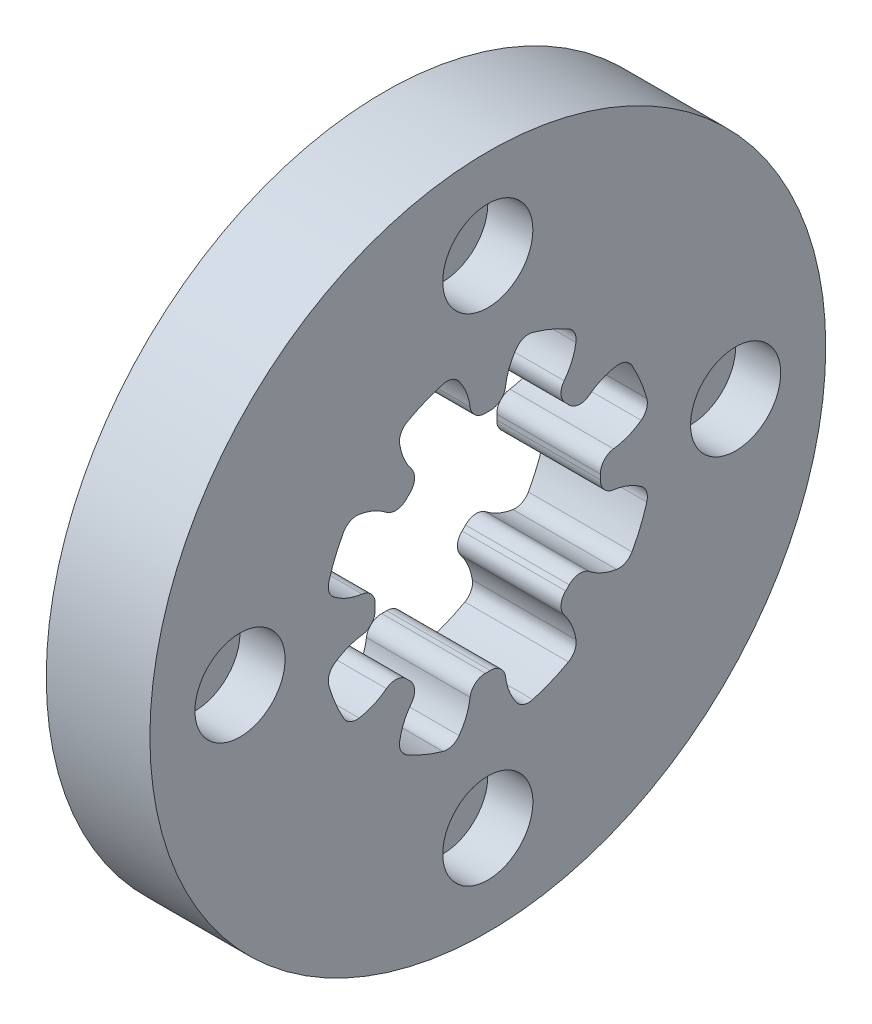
ISO-10303-21;
HEADER;
FILE_DESCRIPTION(('STEP AP214'),'2;1');
FILE_NAME('part.step','',(''),(''),'','','');
FILE_SCHEMA(('AUTOMOTIVE_DESIGN { 1 0 10303 214 1 1 1 1 }'));
ENDSEC;
DATA;
#1=APPLICATION_CONTEXT('core data for automotive mechanical design processes');
#2=APPLICATION_PROTOCOL_DEFINITION('international standard','automotive_design',2000,#1);
#3=PRODUCT_CONTEXT('',#1,'mechanical');
#4=PRODUCT('Part','Part','',(#3));
#5=PRODUCT_RELATED_PRODUCT_CATEGORY('part','',(#4));
#6=PRODUCT_DEFINITION_FORMATION('','',#4);
#7=PRODUCT_DEFINITION_CONTEXT('part definition',#1,'design');
#8=PRODUCT_DEFINITION('design','',#6,#7);
#9=PRODUCT_DEFINITION_SHAPE('','',#8);
#10=(LENGTH_UNIT() NAMED_UNIT(*) SI_UNIT(.MILLI.,.METRE.));
#11=(NAMED_UNIT(*) PLANE_ANGLE_UNIT() SI_UNIT($,.RADIAN.));
#12=(NAMED_UNIT(*) SI_UNIT($,.STERADIAN.) SOLID_ANGLE_UNIT());
#13=UNCERTAINTY_MEASURE_WITH_UNIT(LENGTH_MEASURE(1.E-05),#10,'distance_accuracy_value','');
#14=(GEOMETRIC_REPRESENTATION_CONTEXT(3) GLOBAL_UNCERTAINTY_ASSIGNED_CONTEXT((#13)) GLOBAL_UNIT_ASSIGNED_CONTEXT((#10,
#11,#12)) REPRESENTATION_CONTEXT('',''));
#15=CARTESIAN_POINT('',(0.,0.,0.));
#16=DIRECTION('',(0.,0.,1.));
#17=DIRECTION('',(1.,0.,0.));
#18=AXIS2_PLACEMENT_3D('',#15,#16,#17);
#19=CARTESIAN_POINT('',(0.0999999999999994,0.,0.));
#20=DIRECTION('',(1.,0.,0.));
#21=DIRECTION('',(0.,0.,-1.));
#22=AXIS2_PLACEMENT_3D('',#19,#20,#21);
#23=PLANE('',#22);
#24=CARTESIAN_POINT('',(0.0999999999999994,0.,16.5));
#25=DIRECTION('',(1.,0.,0.));
#26=DIRECTION('',(0.,1.,0.));
#27=AXIS2_PLACEMENT_3D('',#24,#25,#26);
#28=CIRCLE('',#27,1.);
#29=CARTESIAN_POINT('',(0.0999999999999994,0.999999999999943,16.5));
#30=VERTEX_POINT('',#29);
#31=EDGE_CURVE('E1868',#30,#30,#28,.T.);
#32=ORIENTED_EDGE('',*,*,#31,.T.);
#33=EDGE_LOOP('',(#32));
#34=FACE_BOUND('',#33,.T.);
#35=CARTESIAN_POINT('',(0.0999999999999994,-16.5,0.));
#36=DIRECTION('',(1.,0.,0.));
#37=DIRECTION('',(0.,0.,1.));
#38=AXIS2_PLACEMENT_3D('',#35,#36,#37);
#39=CIRCLE('',#38,1.);
#40=CARTESIAN_POINT('',(0.0999999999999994,-16.5,1.));
#41=VERTEX_POINT('',#40);
#42=EDGE_CURVE('E1872',#41,#41,#39,.T.);
#43=ORIENTED_EDGE('',*,*,#42,.T.);
#44=EDGE_LOOP('',(#43));
#45=FACE_BOUND('',#44,.T.);
#46=CARTESIAN_POINT('',(0.0999999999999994,1.72828326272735E-13,-16.5));
#47=DIRECTION('',(1.,0.,0.));
#48=DIRECTION('',(0.,-1.,0.));
#49=AXIS2_PLACEMENT_3D('',#46,#47,#48);
#50=CIRCLE('',#49,1.);
#51=CARTESIAN_POINT('',(0.0999999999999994,-0.999999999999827,-16.5));
#52=VERTEX_POINT('',#51);
#53=EDGE_CURVE('E1882',#52,#52,#50,.T.);
#54=ORIENTED_EDGE('',*,*,#53,.T.);
#55=EDGE_LOOP('',(#54));
#56=FACE_BOUND('',#55,.T.);
#57=CARTESIAN_POINT('',(0.0999999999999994,16.5,0.));
#58=DIRECTION('',(1.,0.,0.));
#59=DIRECTION('',(0.,0.,-1.));
#60=AXIS2_PLACEMENT_3D('',#57,#58,#59);
#61=CIRCLE('',#60,1.);
#62=CARTESIAN_POINT('',(0.0999999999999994,16.5,-1.));
#63=VERTEX_POINT('',#62);
#64=EDGE_CURVE('E1906',#63,#63,#61,.T.);
#65=ORIENTED_EDGE('',*,*,#64,.T.);
#66=EDGE_LOOP('',(#65));
#67=FACE_BOUND('',#66,.T.);
#68=CARTESIAN_POINT('',(0.0999999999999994,0.,0.));
#69=DIRECTION('',(1.,0.,0.));
#70=DIRECTION('',(0.,0.,-1.));
#71=AXIS2_PLACEMENT_3D('',#68,#69,#70);
#72=CIRCLE('',#71,22.5);
#73=CARTESIAN_POINT('',(0.0999999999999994,0.,-22.5));
#74=VERTEX_POINT('',#73);
#75=EDGE_CURVE('E831',#74,#74,#72,.T.);
#76=ORIENTED_EDGE('',*,*,#75,.F.);
#77=EDGE_LOOP('',(#76));
#78=FACE_BOUND('',#77,.T.);
#79=CARTESIAN_POINT('',(0.0999999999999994,0.,0.));
#80=DIRECTION('',(1.,0.,0.));
#81=DIRECTION('',(0.,0.,-1.));
#82=AXIS2_PLACEMENT_3D('',#79,#80,#81);
#83=CIRCLE('',#82,7.499);
#84=CARTESIAN_POINT('',(0.0999999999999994,0.166098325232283,-7.49716028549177));
#85=VERTEX_POINT('',#84);
#86=CARTESIAN_POINT('',(0.0999999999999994,-0.166098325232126,-7.49716028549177));
#87=VERTEX_POINT('',#86);
#88=EDGE_CURVE('E472',#85,#87,#83,.F.);
#89=ORIENTED_EDGE('',*,*,#88,.F.);
#90=CARTESIAN_POINT('',(0.0999999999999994,0.18824772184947,-8.49691495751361));
#91=DIRECTION('',(1.,0.,0.));
#92=DIRECTION('',(0.,0.,-1.));
#93=AXIS2_PLACEMENT_3D('',#90,#91,#92);
#94=CIRCLE('',#93,1.);
#95=CARTESIAN_POINT('',(0.0999999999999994,1.18014002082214,-8.36983361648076));
#96=VERTEX_POINT('',#95);
#97=EDGE_CURVE('E517',#85,#96,#94,.F.);
#98=ORIENTED_EDGE('',*,*,#97,.T.);
#99=CARTESIAN_POINT('',(0.0999999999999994,5.14770921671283,-7.86150825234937));
#100=DIRECTION('',(1.,0.,0.));
#101=DIRECTION('',(0.,0.,-1.));
#102=AXIS2_PLACEMENT_3D('',#99,#100,#101);
#103=CIRCLE('',#102,4.);
#104=CARTESIAN_POINT('',(0.0999999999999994,1.90997257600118,-10.2103508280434));
#105=VERTEX_POINT('',#104);
#106=EDGE_CURVE('E916',#105,#96,#103,.F.);
#107=ORIENTED_EDGE('',*,*,#106,.F.);
#108=CARTESIAN_POINT('',(0.0999999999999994,2.71940673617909,-9.62314018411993));
#109=DIRECTION('',(1.,0.,0.));
#110=DIRECTION('',(0.,0.,-1.));
#111=AXIS2_PLACEMENT_3D('',#108,#109,#110);
#112=CIRCLE('',#111,1.);
#113=CARTESIAN_POINT('',(0.0999999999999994,2.991347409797,-10.5854542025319));
#114=VERTEX_POINT('',#113);
#115=EDGE_CURVE('E694',#105,#114,#112,.T.);
#116=ORIENTED_EDGE('',*,*,#115,.T.);
#117=CARTESIAN_POINT('',(0.0999999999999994,0.,0.));
#118=DIRECTION('',(1.,0.,0.));
#119=DIRECTION('',(0.,0.,-1.));
#120=AXIS2_PLACEMENT_3D('',#117,#118,#119);
#121=CIRCLE('',#120,11.);
#122=CARTESIAN_POINT('',(0.0999999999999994,5.36984441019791,-9.60024848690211));
#123=VERTEX_POINT('',#122);
#124=EDGE_CURVE('E910',#114,#123,#121,.T.);
#125=ORIENTED_EDGE('',*,*,#124,.T.);
#126=CARTESIAN_POINT('',(0.0999999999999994,4.88167673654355,-8.72749862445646));
#127=DIRECTION('',(1.,0.,0.));
#128=DIRECTION('',(0.,0.,-1.));
#129=AXIS2_PLACEMENT_3D('',#126,#127,#128);
#130=CIRCLE('',#129,1.);
#131=CARTESIAN_POINT('',(0.0999999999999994,5.86925374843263,-8.57036286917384));
#132=VERTEX_POINT('',#131);
#133=EDGE_CURVE('E733',#123,#132,#130,.T.);
#134=ORIENTED_EDGE('',*,*,#133,.T.);
#135=CARTESIAN_POINT('',(0.0999999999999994,1.91894570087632,-9.19890589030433));
#136=DIRECTION('',(1.,0.,0.));
#137=DIRECTION('',(0.,0.,-1.));
#138=AXIS2_PLACEMENT_3D('',#135,#136,#137);
#139=CIRCLE('',#138,4.);
#140=CARTESIAN_POINT('',(0.0999999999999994,5.08388109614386,-6.75285111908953));
#141=VERTEX_POINT('',#140);
#142=EDGE_CURVE('E907',#141,#132,#139,.F.);
#143=ORIENTED_EDGE('',*,*,#142,.F.);
#144=CARTESIAN_POINT('',(0.0999999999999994,5.87511494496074,-6.14133742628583));
#145=DIRECTION('',(1.,0.,0.));
#146=DIRECTION('',(0.,0.,-1.));
#147=AXIS2_PLACEMENT_3D('',#144,#145,#146);
#148=CIRCLE('',#147,1.);
#149=CARTESIAN_POINT('',(0.0999999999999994,5.18384362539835,-5.41874212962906));
#150=VERTEX_POINT('',#149);
#151=EDGE_CURVE('E505',#141,#150,#148,.F.);
#152=ORIENTED_EDGE('',*,*,#151,.T.);
#153=CARTESIAN_POINT('',(0.0999999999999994,0.,0.));
#154=DIRECTION('',(1.,0.,0.));
#155=DIRECTION('',(0.,0.,-1.));
#156=AXIS2_PLACEMENT_3D('',#153,#154,#155);
#157=CIRCLE('',#156,7.499);
#158=CARTESIAN_POINT('',(0.0999999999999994,5.41874212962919,-5.18384362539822));
#159=VERTEX_POINT('',#158);
#160=EDGE_CURVE('E904',#159,#150,#157,.F.);
#161=ORIENTED_EDGE('',*,*,#160,.F.);
#162=CARTESIAN_POINT('',(0.0999999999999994,6.14133742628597,-5.87511494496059));
#163=DIRECTION('',(1.,0.,0.));
#164=DIRECTION('',(0.,0.,-1.));
#165=AXIS2_PLACEMENT_3D('',#162,#163,#164);
#166=CIRCLE('',#165,1.);
#167=CARTESIAN_POINT('',(0.0999999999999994,6.75285111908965,-5.08388109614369));
#168=VERTEX_POINT('',#167);
#169=EDGE_CURVE('E489',#159,#168,#166,.F.);
#170=ORIENTED_EDGE('',*,*,#169,.T.);
#171=CARTESIAN_POINT('',(0.0999999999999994,9.19890589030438,-1.91894570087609));
#172=DIRECTION('',(1.,0.,0.));
#173=DIRECTION('',(0.,0.,-1.));
#174=AXIS2_PLACEMENT_3D('',#171,#172,#173);
#175=CIRCLE('',#174,4.);
#176=CARTESIAN_POINT('',(0.0999999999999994,8.57036286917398,-5.86925374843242));
#177=VERTEX_POINT('',#176);
#178=EDGE_CURVE('E896',#177,#168,#175,.F.);
#179=ORIENTED_EDGE('',*,*,#178,.F.);
#180=CARTESIAN_POINT('',(0.0999999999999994,8.72749862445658,-4.88167673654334));
#181=DIRECTION('',(1.,0.,0.));
#182=DIRECTION('',(0.,0.,-1.));
#183=AXIS2_PLACEMENT_3D('',#180,#181,#182);
#184=CIRCLE('',#183,1.);
#185=CARTESIAN_POINT('',(0.0999999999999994,9.60024848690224,-5.36984441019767));
#186=VERTEX_POINT('',#185);
#187=EDGE_CURVE('E741',#177,#186,#184,.T.);
#188=ORIENTED_EDGE('',*,*,#187,.T.);
#189=CARTESIAN_POINT('',(0.0999999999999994,0.,0.));
#190=DIRECTION('',(1.,0.,0.));
#191=DIRECTION('',(0.,0.,-1.));
#192=AXIS2_PLACEMENT_3D('',#189,#190,#191);
#193=CIRCLE('',#192,11.);
#194=CARTESIAN_POINT('',(0.0999999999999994,10.585454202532,-2.99134740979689));
#195=VERTEX_POINT('',#194);
#196=EDGE_CURVE('E751',#186,#195,#193,.T.);
#197=ORIENTED_EDGE('',*,*,#196,.T.);
#198=CARTESIAN_POINT('',(0.0999999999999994,9.62314018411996,-2.71940673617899));
#199=DIRECTION('',(1.,0.,0.));
#200=DIRECTION('',(0.,0.,-1.));
#201=AXIS2_PLACEMENT_3D('',#198,#199,#200);
#202=CIRCLE('',#201,1.);
#203=CARTESIAN_POINT('',(0.0999999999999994,10.2103508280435,-1.90997257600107));
#204=VERTEX_POINT('',#203);
#205=EDGE_CURVE('E47',#195,#204,#202,.T.);
#206=ORIENTED_EDGE('',*,*,#205,.T.);
#207=CARTESIAN_POINT('',(0.0999999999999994,7.86150825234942,-5.14770921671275));
#208=DIRECTION('',(1.,0.,0.));
#209=DIRECTION('',(0.,0.,-1.));
#210=AXIS2_PLACEMENT_3D('',#207,#208,#209);
#211=CIRCLE('',#210,4.);
#212=CARTESIAN_POINT('',(0.0999999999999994,8.36983361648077,-1.18014002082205));
#213=VERTEX_POINT('',#212);
#214=EDGE_CURVE('E749',#213,#204,#211,.F.);
#215=ORIENTED_EDGE('',*,*,#214,.F.);
#216=CARTESIAN_POINT('',(0.0999999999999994,8.49691495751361,-0.188247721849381));
#217=DIRECTION('',(1.,0.,0.));
#218=DIRECTION('',(0.,0.,-1.));
#219=AXIS2_PLACEMENT_3D('',#216,#217,#218);
#220=CIRCLE('',#219,1.);
#221=CARTESIAN_POINT('',(0.0999999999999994,7.49716028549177,-0.166098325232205));
#222=VERTEX_POINT('',#221);
#223=EDGE_CURVE('E487',#213,#222,#220,.F.);
#224=ORIENTED_EDGE('',*,*,#223,.T.);
#225=CARTESIAN_POINT('',(0.0999999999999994,0.,0.));
#226=DIRECTION('',(1.,0.,0.));
#227=DIRECTION('',(0.,0.,-1.));
#228=AXIS2_PLACEMENT_3D('',#225,#226,#227);
#229=CIRCLE('',#228,7.499);
#230=CARTESIAN_POINT('',(0.0999999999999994,7.49716028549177,0.166098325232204));
#231=VERTEX_POINT('',#230);
#232=EDGE_CURVE('E760',#231,#222,#229,.F.);
#233=ORIENTED_EDGE('',*,*,#232,.F.);
#234=CARTESIAN_POINT('',(0.0999999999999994,8.49691495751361,0.188247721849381));
#235=DIRECTION('',(1.,0.,0.));
#236=DIRECTION('',(0.,0.,-1.));
#237=AXIS2_PLACEMENT_3D('',#234,#235,#236);
#238=CIRCLE('',#237,1.);
#239=CARTESIAN_POINT('',(0.0999999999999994,8.36983361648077,1.18014002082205));
#240=VERTEX_POINT('',#239);
#241=EDGE_CURVE('E491',#231,#240,#238,.F.);
#242=ORIENTED_EDGE('',*,*,#241,.T.);
#243=CARTESIAN_POINT('',(0.0999999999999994,7.86150825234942,5.14770921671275));
#244=DIRECTION('',(1.,0.,0.));
#245=DIRECTION('',(0.,0.,-1.));
#246=AXIS2_PLACEMENT_3D('',#243,#244,#245);
#247=CIRCLE('',#246,4.);
#248=CARTESIAN_POINT('',(0.0999999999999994,10.2103508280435,1.90997257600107));
#249=VERTEX_POINT('',#248);
#250=EDGE_CURVE('E878',#249,#240,#247,.F.);
#251=ORIENTED_EDGE('',*,*,#250,.F.);
#252=CARTESIAN_POINT('',(0.0999999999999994,9.62314018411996,2.71940673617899));
#253=DIRECTION('',(1.,0.,0.));
#254=DIRECTION('',(0.,0.,-1.));
#255=AXIS2_PLACEMENT_3D('',#252,#253,#254);
#256=CIRCLE('',#255,1.);
#257=CARTESIAN_POINT('',(0.0999999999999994,10.585454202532,2.99134740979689));
#258=VERTEX_POINT('',#257);
#259=EDGE_CURVE('E737',#249,#258,#256,.T.);
#260=ORIENTED_EDGE('',*,*,#259,.T.);
#261=CARTESIAN_POINT('',(0.0999999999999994,0.,0.));
#262=DIRECTION('',(1.,0.,0.));
#263=DIRECTION('',(0.,0.,-1.));
#264=AXIS2_PLACEMENT_3D('',#261,#262,#263);
#265=CIRCLE('',#264,11.);
#266=CARTESIAN_POINT('',(0.0999999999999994,9.60024848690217,5.36984441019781));
#267=VERTEX_POINT('',#266);
#268=EDGE_CURVE('E869',#258,#267,#265,.T.);
#269=ORIENTED_EDGE('',*,*,#268,.T.);
#270=CARTESIAN_POINT('',(0.0999999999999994,8.72749862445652,4.88167673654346));
#271=DIRECTION('',(1.,0.,0.));
#272=DIRECTION('',(0.,0.,-1.));
#273=AXIS2_PLACEMENT_3D('',#270,#271,#272);
#274=CIRCLE('',#273,1.);
#275=CARTESIAN_POINT('',(0.0999999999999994,8.57036286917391,5.86925374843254));
#276=VERTEX_POINT('',#275);
#277=EDGE_CURVE('E725',#267,#276,#274,.T.);
#278=ORIENTED_EDGE('',*,*,#277,.T.);
#279=CARTESIAN_POINT('',(0.0999999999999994,9.19890589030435,1.91894570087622));
#280=DIRECTION('',(1.,0.,0.));
#281=DIRECTION('',(0.,0.,-1.));
#282=AXIS2_PLACEMENT_3D('',#279,#280,#281);
#283=CIRCLE('',#282,4.);
#284=CARTESIAN_POINT('',(0.0999999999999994,6.75285111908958,5.08388109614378));
#285=VERTEX_POINT('',#284);
#286=EDGE_CURVE('E866',#285,#276,#283,.F.);
#287=ORIENTED_EDGE('',*,*,#286,.F.);
#288=CARTESIAN_POINT('',(0.0999999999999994,6.14133742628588,5.87511494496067));
#289=DIRECTION('',(1.,0.,0.));
#290=DIRECTION('',(0.,0.,-1.));
#291=AXIS2_PLACEMENT_3D('',#288,#289,#290);
#292=CIRCLE('',#291,1.);
#293=CARTESIAN_POINT('',(0.0999999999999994,5.41874212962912,5.18384362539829));
#294=VERTEX_POINT('',#293);
#295=EDGE_CURVE('E493',#285,#294,#292,.F.);
#296=ORIENTED_EDGE('',*,*,#295,.T.);
#297=CARTESIAN_POINT('',(0.0999999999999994,0.,0.));
#298=DIRECTION('',(1.,0.,0.));
#299=DIRECTION('',(0.,0.,-1.));
#300=AXIS2_PLACEMENT_3D('',#297,#298,#299);
#301=CIRCLE('',#300,7.499);
#302=CARTESIAN_POINT('',(0.0999999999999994,5.18384362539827,5.41874212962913));
#303=VERTEX_POINT('',#302);
#304=EDGE_CURVE('E863',#303,#294,#301,.F.);
#305=ORIENTED_EDGE('',*,*,#304,.F.);
#306=CARTESIAN_POINT('',(0.0999999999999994,5.87511494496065,6.14133742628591));
#307=DIRECTION('',(1.,0.,0.));
#308=DIRECTION('',(0.,0.,-1.));
#309=AXIS2_PLACEMENT_3D('',#306,#307,#308);
#310=CIRCLE('',#309,1.);
#311=CARTESIAN_POINT('',(0.0999999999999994,5.08388109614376,6.7528511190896));
#312=VERTEX_POINT('',#311);
#313=EDGE_CURVE('E495',#303,#312,#310,.F.);
#314=ORIENTED_EDGE('',*,*,#313,.T.);
#315=CARTESIAN_POINT('',(0.0999999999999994,1.91894570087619,9.19890589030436));
#316=DIRECTION('',(1.,0.,0.));
#317=DIRECTION('',(0.,0.,-1.));
#318=AXIS2_PLACEMENT_3D('',#315,#316,#317);
#319=CIRCLE('',#318,4.);
#320=CARTESIAN_POINT('',(0.0999999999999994,5.86925374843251,8.57036286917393));
#321=VERTEX_POINT('',#320);
#322=EDGE_CURVE('E854',#321,#312,#319,.F.);
#323=ORIENTED_EDGE('',*,*,#322,.F.);
#324=CARTESIAN_POINT('',(0.0999999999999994,4.88167673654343,8.72749862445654));
#325=DIRECTION('',(1.,0.,0.));
#326=DIRECTION('',(0.,0.,-1.));
#327=AXIS2_PLACEMENT_3D('',#324,#325,#326);
#328=CIRCLE('',#327,1.);
#329=CARTESIAN_POINT('',(0.0999999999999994,5.36984441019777,9.60024848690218));
#330=VERTEX_POINT('',#329);
#331=EDGE_CURVE('E729',#321,#330,#328,.T.);
#332=ORIENTED_EDGE('',*,*,#331,.T.);
#333=CARTESIAN_POINT('',(0.0999999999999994,0.,0.));
#334=DIRECTION('',(1.,0.,0.));
#335=DIRECTION('',(0.,0.,-1.));
#336=AXIS2_PLACEMENT_3D('',#333,#334,#335);
#337=CIRCLE('',#336,11.);
#338=CARTESIAN_POINT('',(0.0999999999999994,2.99134740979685,10.585454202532));
#339=VERTEX_POINT('',#338);
#340=EDGE_CURVE('E848',#330,#339,#337,.T.);
#341=ORIENTED_EDGE('',*,*,#340,.T.);
#342=CARTESIAN_POINT('',(0.0999999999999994,2.71940673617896,9.62314018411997));
#343=DIRECTION('',(1.,0.,0.));
#344=DIRECTION('',(0.,0.,-1.));
#345=AXIS2_PLACEMENT_3D('',#342,#343,#344);
#346=CIRCLE('',#345,1.);
#347=CARTESIAN_POINT('',(0.0999999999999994,1.90997257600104,10.2103508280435));
#348=VERTEX_POINT('',#347);
#349=EDGE_CURVE('E721',#339,#348,#346,.T.);
#350=ORIENTED_EDGE('',*,*,#349,.T.);
#351=CARTESIAN_POINT('',(0.0999999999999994,5.14770921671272,7.86150825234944));
#352=DIRECTION('',(1.,0.,0.));
#353=DIRECTION('',(0.,0.,-1.));
#354=AXIS2_PLACEMENT_3D('',#351,#352,#353);
#355=CIRCLE('',#354,4.);
#356=CARTESIAN_POINT('',(0.0999999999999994,1.18014002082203,8.36983361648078));
#357=VERTEX_POINT('',#356);
#358=EDGE_CURVE('E842',#357,#348,#355,.F.);
#359=ORIENTED_EDGE('',*,*,#358,.F.);
#360=CARTESIAN_POINT('',(0.0999999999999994,0.188247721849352,8.49691495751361));
#361=DIRECTION('',(1.,0.,0.));
#362=DIRECTION('',(0.,0.,-1.));
#363=AXIS2_PLACEMENT_3D('',#360,#361,#362);
#364=CIRCLE('',#363,1.);
#365=CARTESIAN_POINT('',(0.0999999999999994,0.166098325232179,7.49716028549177));
#366=VERTEX_POINT('',#365);
#367=EDGE_CURVE('E507',#357,#366,#364,.F.);
#368=ORIENTED_EDGE('',*,*,#367,.T.);
#369=CARTESIAN_POINT('',(0.0999999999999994,0.,0.));
#370=DIRECTION('',(1.,0.,0.));
#371=DIRECTION('',(0.,0.,-1.));
#372=AXIS2_PLACEMENT_3D('',#369,#370,#371);
#373=CIRCLE('',#372,7.499);
#374=CARTESIAN_POINT('',(0.0999999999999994,-0.166098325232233,7.49716028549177));
#375=VERTEX_POINT('',#374);
#376=EDGE_CURVE('E834',#375,#366,#373,.F.);
#377=ORIENTED_EDGE('',*,*,#376,.F.);
#378=CARTESIAN_POINT('',(0.0999999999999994,-0.188247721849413,8.49691495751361));
#379=DIRECTION('',(1.,0.,0.));
#380=DIRECTION('',(0.,0.,-1.));
#381=AXIS2_PLACEMENT_3D('',#378,#379,#380);
#382=CIRCLE('',#381,1.);
#383=CARTESIAN_POINT('',(0.0999999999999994,-1.18014002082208,8.36983361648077));
#384=VERTEX_POINT('',#383);
#385=EDGE_CURVE('E497',#375,#384,#382,.F.);
#386=ORIENTED_EDGE('',*,*,#385,.T.);
#387=CARTESIAN_POINT('',(0.0999999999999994,-5.14770921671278,7.86150825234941));
#388=DIRECTION('',(1.,0.,0.));
#389=DIRECTION('',(0.,0.,-1.));
#390=AXIS2_PLACEMENT_3D('',#387,#388,#389);
#391=CIRCLE('',#390,4.);
#392=CARTESIAN_POINT('',(0.0999999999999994,-1.90997257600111,10.2103508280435));
#393=VERTEX_POINT('',#392);
#394=EDGE_CURVE('E839',#393,#384,#391,.F.);
#395=ORIENTED_EDGE('',*,*,#394,.F.);
#396=CARTESIAN_POINT('',(0.0999999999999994,-2.71940673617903,9.62314018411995));
#397=DIRECTION('',(1.,0.,0.));
#398=DIRECTION('',(0.,0.,-1.));
#399=AXIS2_PLACEMENT_3D('',#396,#397,#398);
#400=CIRCLE('',#399,1.);
#401=CARTESIAN_POINT('',(0.0999999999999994,-2.99134740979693,10.5854542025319));
#402=VERTEX_POINT('',#401);
#403=EDGE_CURVE('E717',#393,#402,#400,.T.);
#404=ORIENTED_EDGE('',*,*,#403,.T.);
#405=CARTESIAN_POINT('',(0.0999999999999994,0.,0.));
#406=DIRECTION('',(1.,0.,0.));
#407=DIRECTION('',(0.,0.,-1.));
#408=AXIS2_PLACEMENT_3D('',#405,#406,#407);
#409=CIRCLE('',#408,11.);
#410=CARTESIAN_POINT('',(0.0999999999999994,-5.36984441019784,9.60024848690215));
#411=VERTEX_POINT('',#410);
#412=EDGE_CURVE('E845',#402,#411,#409,.T.);
#413=ORIENTED_EDGE('',*,*,#412,.T.);
#414=CARTESIAN_POINT('',(0.0999999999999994,-4.88167673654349,8.7274986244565));
#415=DIRECTION('',(1.,0.,0.));
#416=DIRECTION('',(0.,0.,-1.));
#417=AXIS2_PLACEMENT_3D('',#414,#415,#416);
#418=CIRCLE('',#417,1.);
#419=CARTESIAN_POINT('',(0.0999999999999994,-5.86925374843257,8.57036286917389));
#420=VERTEX_POINT('',#419);
#421=EDGE_CURVE('E710',#411,#420,#418,.T.);
#422=ORIENTED_EDGE('',*,*,#421,.T.);
#423=CARTESIAN_POINT('',(0.0999999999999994,-1.91894570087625,9.19890589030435));
#424=DIRECTION('',(1.,0.,0.));
#425=DIRECTION('',(0.,0.,-1.));
#426=AXIS2_PLACEMENT_3D('',#423,#424,#425);
#427=CIRCLE('',#426,4.);
#428=CARTESIAN_POINT('',(0.0999999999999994,-5.08388109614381,6.75285111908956));
#429=VERTEX_POINT('',#428);
#430=EDGE_CURVE('E851',#429,#420,#427,.F.);
#431=ORIENTED_EDGE('',*,*,#430,.F.);
#432=CARTESIAN_POINT('',(0.0999999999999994,-5.8751149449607,6.14133742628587));
#433=DIRECTION('',(1.,0.,0.));
#434=DIRECTION('',(0.,0.,-1.));
#435=AXIS2_PLACEMENT_3D('',#432,#433,#434);
#436=CIRCLE('',#435,1.);
#437=CARTESIAN_POINT('',(0.0999999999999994,-5.18384362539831,5.4187421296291));
#438=VERTEX_POINT('',#437);
#439=EDGE_CURVE('E509',#429,#438,#436,.F.);
#440=ORIENTED_EDGE('',*,*,#439,.T.);
#441=CARTESIAN_POINT('',(0.0999999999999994,0.,0.));
#442=DIRECTION('',(1.,0.,0.));
#443=DIRECTION('',(0.,0.,-1.));
#444=AXIS2_PLACEMENT_3D('',#441,#442,#443);
#445=CIRCLE('',#444,7.499);
#446=CARTESIAN_POINT('',(0.0999999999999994,-5.41874212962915,5.18384362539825));
#447=VERTEX_POINT('',#446);
#448=EDGE_CURVE('E857',#447,#438,#445,.F.);
#449=ORIENTED_EDGE('',*,*,#448,.F.);
#450=CARTESIAN_POINT('',(0.0999999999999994,-6.14133742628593,5.87511494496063));
#451=DIRECTION('',(1.,0.,0.));
#452=DIRECTION('',(0.,0.,-1.));
#453=AXIS2_PLACEMENT_3D('',#450,#451,#452);
#454=CIRCLE('',#453,1.);
#455=CARTESIAN_POINT('',(0.0999999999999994,-6.75285111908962,5.08388109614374));
#456=VERTEX_POINT('',#455);
#457=EDGE_CURVE('E499',#447,#456,#454,.F.);
#458=ORIENTED_EDGE('',*,*,#457,.T.);
#459=CARTESIAN_POINT('',(0.0999999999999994,-9.19890589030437,1.91894570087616));
#460=DIRECTION('',(1.,0.,0.));
#461=DIRECTION('',(0.,0.,-1.));
#462=AXIS2_PLACEMENT_3D('',#459,#460,#461);
#463=CIRCLE('',#462,4.);
#464=CARTESIAN_POINT('',(0.0999999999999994,-8.57036286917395,5.86925374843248));
#465=VERTEX_POINT('',#464);
#466=EDGE_CURVE('E860',#465,#456,#463,.F.);
#467=ORIENTED_EDGE('',*,*,#466,.F.);
#468=CARTESIAN_POINT('',(0.0999999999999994,-8.72749862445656,4.8816767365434));
#469=DIRECTION('',(1.,0.,0.));
#470=DIRECTION('',(0.,0.,-1.));
#471=AXIS2_PLACEMENT_3D('',#468,#469,#470);
#472=CIRCLE('',#471,1.);
#473=CARTESIAN_POINT('',(0.0999999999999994,-9.60024848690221,5.36984441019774));
#474=VERTEX_POINT('',#473);
#475=EDGE_CURVE('E713',#465,#474,#472,.T.);
#476=ORIENTED_EDGE('',*,*,#475,.T.);
#477=CARTESIAN_POINT('',(0.0999999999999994,0.,0.));
#478=DIRECTION('',(1.,0.,0.));
#479=DIRECTION('',(0.,0.,-1.));
#480=AXIS2_PLACEMENT_3D('',#477,#478,#479);
#481=CIRCLE('',#480,11.);
#482=CARTESIAN_POINT('',(0.0999999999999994,-10.585454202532,2.99134740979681));
#483=VERTEX_POINT('',#482);
#484=EDGE_CURVE('E872',#474,#483,#481,.T.);
#485=ORIENTED_EDGE('',*,*,#484,.T.);
#486=CARTESIAN_POINT('',(0.0999999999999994,-9.62314018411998,2.71940673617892));
#487=DIRECTION('',(1.,0.,0.));
#488=DIRECTION('',(0.,0.,-1.));
#489=AXIS2_PLACEMENT_3D('',#486,#487,#488);
#490=CIRCLE('',#489,1.);
#491=CARTESIAN_POINT('',(0.0999999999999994,-10.2103508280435,1.909972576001));
#492=VERTEX_POINT('',#491);
#493=EDGE_CURVE('E706',#483,#492,#490,.T.);
#494=ORIENTED_EDGE('',*,*,#493,.T.);
#495=CARTESIAN_POINT('',(0.0999999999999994,-7.86150825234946,5.14770921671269));
#496=DIRECTION('',(1.,0.,0.));
#497=DIRECTION('',(0.,0.,-1.));
#498=AXIS2_PLACEMENT_3D('',#495,#496,#497);
#499=CIRCLE('',#498,4.);
#500=CARTESIAN_POINT('',(0.0999999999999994,-8.36983361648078,1.180140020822));
#501=VERTEX_POINT('',#500);
#502=EDGE_CURVE('E875',#501,#492,#499,.F.);
#503=ORIENTED_EDGE('',*,*,#502,.F.);
#504=CARTESIAN_POINT('',(0.0999999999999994,-8.49691495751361,0.188247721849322));
#505=DIRECTION('',(1.,0.,0.));
#506=DIRECTION('',(0.,0.,-1.));
#507=AXIS2_PLACEMENT_3D('',#504,#505,#506);
#508=CIRCLE('',#507,1.);
#509=CARTESIAN_POINT('',(0.0999999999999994,-7.49716028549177,0.166098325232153));
#510=VERTEX_POINT('',#509);
#511=EDGE_CURVE('E511',#501,#510,#508,.F.);
#512=ORIENTED_EDGE('',*,*,#511,.T.);
#513=CARTESIAN_POINT('',(0.0999999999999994,0.,0.));
#514=DIRECTION('',(1.,0.,0.));
#515=DIRECTION('',(0.,0.,-1.));
#516=AXIS2_PLACEMENT_3D('',#513,#514,#515);
#517=CIRCLE('',#516,7.499);
#518=CARTESIAN_POINT('',(0.0999999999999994,-7.49716028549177,-0.16609832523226));
#519=VERTEX_POINT('',#518);
#520=EDGE_CURVE('E881',#519,#510,#517,.F.);
#521=ORIENTED_EDGE('',*,*,#520,.F.);
#522=CARTESIAN_POINT('',(0.0999999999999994,-8.49691495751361,-0.188247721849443));
#523=DIRECTION('',(1.,0.,0.));
#524=DIRECTION('',(0.,0.,-1.));
#525=AXIS2_PLACEMENT_3D('',#522,#523,#524);
#526=CIRCLE('',#525,1.);
#527=CARTESIAN_POINT('',(0.0999999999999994,-8.36983361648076,-1.18014002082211));
#528=VERTEX_POINT('',#527);
#529=EDGE_CURVE('E513',#519,#528,#526,.F.);
#530=ORIENTED_EDGE('',*,*,#529,.T.);
#531=CARTESIAN_POINT('',(0.0999999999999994,-7.86150825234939,-5.1477092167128));
#532=DIRECTION('',(1.,0.,0.));
#533=DIRECTION('',(0.,0.,-1.));
#534=AXIS2_PLACEMENT_3D('',#531,#532,#533);
#535=CIRCLE('',#534,4.);
#536=CARTESIAN_POINT('',(0.0999999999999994,-10.2103508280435,-1.90997257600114));
#537=VERTEX_POINT('',#536);
#538=EDGE_CURVE('E884',#537,#528,#535,.F.);
#539=ORIENTED_EDGE('',*,*,#538,.F.);
#540=CARTESIAN_POINT('',(0.0999999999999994,-9.62314018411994,-2.71940673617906));
#541=DIRECTION('',(1.,0.,0.));
#542=DIRECTION('',(0.,0.,-1.));
#543=AXIS2_PLACEMENT_3D('',#540,#541,#542);
#544=CIRCLE('',#543,1.);
#545=CARTESIAN_POINT('',(0.0999999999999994,-10.5854542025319,-2.99134740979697));
#546=VERTEX_POINT('',#545);
#547=EDGE_CURVE('E702',#537,#546,#544,.T.);
#548=ORIENTED_EDGE('',*,*,#547,.T.);
#549=CARTESIAN_POINT('',(0.0999999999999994,0.,0.));
#550=DIRECTION('',(1.,0.,0.));
#551=DIRECTION('',(0.,0.,-1.));
#552=AXIS2_PLACEMENT_3D('',#549,#550,#551);
#553=CIRCLE('',#552,11.);
#554=CARTESIAN_POINT('',(0.0999999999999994,-9.60024848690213,-5.36984441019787));
#555=VERTEX_POINT('',#554);
#556=EDGE_CURVE('E890',#546,#555,#553,.T.);
#557=ORIENTED_EDGE('',*,*,#556,.T.);
#558=CARTESIAN_POINT('',(0.0999999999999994,-8.72749862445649,-4.88167673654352));
#559=DIRECTION('',(1.,0.,0.));
#560=DIRECTION('',(0.,0.,-1.));
#561=AXIS2_PLACEMENT_3D('',#558,#559,#560);
#562=CIRCLE('',#561,1.);
#563=CARTESIAN_POINT('',(0.0999999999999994,-8.57036286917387,-5.8692537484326));
#564=VERTEX_POINT('',#563);
#565=EDGE_CURVE('E698',#555,#564,#562,.T.);
#566=ORIENTED_EDGE('',*,*,#565,.T.);
#567=CARTESIAN_POINT('',(0.0999999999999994,-9.19890589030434,-1.91894570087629));
#568=DIRECTION('',(1.,0.,0.));
#569=DIRECTION('',(0.,0.,-1.));
#570=AXIS2_PLACEMENT_3D('',#567,#568,#569);
#571=CIRCLE('',#570,4.);
#572=CARTESIAN_POINT('',(0.0999999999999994,-6.75285111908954,-5.08388109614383));
#573=VERTEX_POINT('',#572);
#574=EDGE_CURVE('E893',#573,#564,#571,.F.);
#575=ORIENTED_EDGE('',*,*,#574,.F.);
#576=CARTESIAN_POINT('',(0.0999999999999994,-6.14133742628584,-5.87511494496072));
#577=DIRECTION('',(1.,0.,0.));
#578=DIRECTION('',(0.,0.,-1.));
#579=AXIS2_PLACEMENT_3D('',#576,#577,#578);
#580=CIRCLE('',#579,1.);
#581=CARTESIAN_POINT('',(0.0999999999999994,-5.41874212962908,-5.18384362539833));
#582=VERTEX_POINT('',#581);
#583=EDGE_CURVE('E501',#573,#582,#580,.F.);
#584=ORIENTED_EDGE('',*,*,#583,.T.);
#585=CARTESIAN_POINT('',(0.0999999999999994,0.,0.));
#586=DIRECTION('',(1.,0.,0.));
#587=DIRECTION('',(0.,0.,-1.));
#588=AXIS2_PLACEMENT_3D('',#585,#586,#587);
#589=CIRCLE('',#588,7.499);
#590=CARTESIAN_POINT('',(0.0999999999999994,-5.18384362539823,-5.41874212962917));
#591=VERTEX_POINT('',#590);
#592=EDGE_CURVE('E899',#591,#582,#589,.F.);
#593=ORIENTED_EDGE('',*,*,#592,.F.);
#594=CARTESIAN_POINT('',(0.0999999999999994,-5.87511494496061,-6.14133742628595));
#595=DIRECTION('',(1.,0.,0.));
#596=DIRECTION('',(0.,0.,-1.));
#597=AXIS2_PLACEMENT_3D('',#594,#595,#596);
#598=CIRCLE('',#597,1.);
#599=CARTESIAN_POINT('',(0.0999999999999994,-5.08388109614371,-6.75285111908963));
#600=VERTEX_POINT('',#599);
#601=EDGE_CURVE('E515',#591,#600,#598,.F.);
#602=ORIENTED_EDGE('',*,*,#601,.T.);
#603=CARTESIAN_POINT('',(0.0999999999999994,-1.91894570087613,-9.19890589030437));
#604=DIRECTION('',(1.,0.,0.));
#605=DIRECTION('',(0.,0.,-1.));
#606=AXIS2_PLACEMENT_3D('',#603,#604,#605);
#607=CIRCLE('',#606,4.);
#608=CARTESIAN_POINT('',(0.0999999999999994,-5.86925374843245,-8.57036286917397));
#609=VERTEX_POINT('',#608);
#610=EDGE_CURVE('E902',#609,#600,#607,.F.);
#611=ORIENTED_EDGE('',*,*,#610,.F.);
#612=CARTESIAN_POINT('',(0.0999999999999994,-4.88167673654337,-8.72749862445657));
#613=DIRECTION('',(1.,0.,0.));
#614=DIRECTION('',(0.,0.,-1.));
#615=AXIS2_PLACEMENT_3D('',#612,#613,#614);
#616=CIRCLE('',#615,1.);
#617=CARTESIAN_POINT('',(0.0999999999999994,-5.3698444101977,-9.60024848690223));
#618=VERTEX_POINT('',#617);
#619=EDGE_CURVE('E454',#609,#618,#616,.T.);
#620=ORIENTED_EDGE('',*,*,#619,.T.);
#621=CARTESIAN_POINT('',(0.0999999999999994,0.,0.));
#622=DIRECTION('',(1.,0.,0.));
#623=DIRECTION('',(0.,0.,-1.));
#624=AXIS2_PLACEMENT_3D('',#621,#622,#623);
#625=CIRCLE('',#624,11.);
#626=CARTESIAN_POINT('',(0.0999999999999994,-2.99134740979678,-10.585454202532));
#627=VERTEX_POINT('',#626);
#628=EDGE_CURVE('E913',#618,#627,#625,.T.);
#629=ORIENTED_EDGE('',*,*,#628,.T.);
#630=CARTESIAN_POINT('',(0.0999999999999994,-2.71940673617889,-9.62314018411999));
#631=DIRECTION('',(1.,0.,0.));
#632=DIRECTION('',(0.,0.,-1.));
#633=AXIS2_PLACEMENT_3D('',#630,#631,#632);
#634=CIRCLE('',#633,1.);
#635=CARTESIAN_POINT('',(0.0999999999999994,-1.90997257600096,-10.2103508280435));
#636=VERTEX_POINT('',#635);
#637=EDGE_CURVE('E453',#627,#636,#634,.T.);
#638=ORIENTED_EDGE('',*,*,#637,.T.);
#639=CARTESIAN_POINT('',(0.0999999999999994,-5.14770921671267,-7.86150825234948));
#640=DIRECTION('',(1.,0.,0.));
#641=DIRECTION('',(0.,0.,-1.));
#642=AXIS2_PLACEMENT_3D('',#639,#640,#641);
#643=CIRCLE('',#642,4.);
#644=CARTESIAN_POINT('',(0.0999999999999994,-1.18014002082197,-8.36983361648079));
#645=VERTEX_POINT('',#644);
#646=EDGE_CURVE('E919',#645,#636,#643,.F.);
#647=ORIENTED_EDGE('',*,*,#646,.F.);
#648=CARTESIAN_POINT('',(0.0999999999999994,-0.188247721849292,-8.49691495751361));
#649=DIRECTION('',(1.,0.,0.));
#650=DIRECTION('',(0.,0.,-1.));
#651=AXIS2_PLACEMENT_3D('',#648,#649,#650);
#652=CIRCLE('',#651,1.);
#653=EDGE_CURVE('E503',#645,#87,#652,.F.);
#654=ORIENTED_EDGE('',*,*,#653,.T.);
#655=EDGE_LOOP('',(#89,#98,#107,#116,#125,#134,#143,#152,#161,#170,#179,#188,#197,#206,#215,
#224,#233,#242,#251,#260,#269,#278,#287,#296,#305,#314,#323,#332,#341,#350,#359,#368,#377,#386,
#395,#404,#413,#422,#431,#440,#449,#458,#467,#476,#485,#494,#503,#512,#521,#530,#539,#548,#557,
#566,#575,#584,#593,#602,#611,#620,#629,#638,#647,#654));
#656=FACE_BOUND('',#655,.T.);
#657=ADVANCED_FACE('F39',(#34,#45,#56,#67,#78,#656),#23,.F.);
#658=CARTESIAN_POINT('',(0.0999999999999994,0.,0.));
#659=DIRECTION('',(1.,0.,0.));
#660=DIRECTION('',(0.,0.,-1.));
#661=AXIS2_PLACEMENT_3D('',#658,#659,#660);
#662=CYLINDRICAL_SURFACE('',#661,22.5);
#663=CARTESIAN_POINT('',(7.,0.,0.));
#664=DIRECTION('',(1.,0.,0.));
#665=DIRECTION('',(0.,0.,-1.));
#666=AXIS2_PLACEMENT_3D('',#663,#664,#665);
#667=CIRCLE('',#666,22.5);
#668=CARTESIAN_POINT('',(7.,0.,-22.5));
#669=VERTEX_POINT('',#668);
#670=EDGE_CURVE('E830',#669,#669,#667,.T.);
#671=CARTESIAN_POINT('',(0.0999999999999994,0.,-22.5));
#672=CARTESIAN_POINT('',(0.171874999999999,0.,-22.5));
#673=CARTESIAN_POINT('',(0.243749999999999,0.,-22.5));
#674=CARTESIAN_POINT('',(0.387499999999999,0.,-22.5));
#675=CARTESIAN_POINT('',(0.459374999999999,0.,-22.5));
#676=CARTESIAN_POINT('',(0.603124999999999,0.,-22.5));
#677=CARTESIAN_POINT('',(0.674999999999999,0.,-22.5));
#678=CARTESIAN_POINT('',(0.818749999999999,0.,-22.5));
#679=CARTESIAN_POINT('',(0.890624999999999,0.,-22.5));
#680=CARTESIAN_POINT('',(1.034375,0.,-22.5));
#681=CARTESIAN_POINT('',(1.10625,0.,-22.5));
#682=CARTESIAN_POINT('',(1.25,0.,-22.5));
#683=CARTESIAN_POINT('',(1.321875,0.,-22.5));
#684=CARTESIAN_POINT('',(1.465625,0.,-22.5));
#685=CARTESIAN_POINT('',(1.5375,0.,-22.5));
#686=CARTESIAN_POINT('',(1.68125,0.,-22.5));
#687=CARTESIAN_POINT('',(1.753125,0.,-22.5));
#688=CARTESIAN_POINT('',(1.896875,0.,-22.5));
#689=CARTESIAN_POINT('',(1.96875,0.,-22.5));
#690=CARTESIAN_POINT('',(2.1125,0.,-22.5));
#691=CARTESIAN_POINT('',(2.184375,0.,-22.5));
#692=CARTESIAN_POINT('',(2.328125,0.,-22.5));
#693=CARTESIAN_POINT('',(2.4,0.,-22.5));
#694=CARTESIAN_POINT('',(2.54375,0.,-22.5));
#695=CARTESIAN_POINT('',(2.615625,0.,-22.5));
#696=CARTESIAN_POINT('',(2.759375,0.,-22.5));
#697=CARTESIAN_POINT('',(2.83125,0.,-22.5));
#698=CARTESIAN_POINT('',(2.975,0.,-22.5));
#699=CARTESIAN_POINT('',(3.046875,0.,-22.5));
#700=CARTESIAN_POINT('',(3.190625,0.,-22.5));
#701=CARTESIAN_POINT('',(3.2625,0.,-22.5));
#702=CARTESIAN_POINT('',(3.40625,0.,-22.5));
#703=CARTESIAN_POINT('',(3.478125,0.,-22.5));
#704=CARTESIAN_POINT('',(3.621875,0.,-22.5));
#705=CARTESIAN_POINT('',(3.69375,0.,-22.5));
#706=CARTESIAN_POINT('',(3.8375,0.,-22.5));
#707=CARTESIAN_POINT('',(3.909375,0.,-22.5));
#708=CARTESIAN_POINT('',(4.053125,0.,-22.5));
#709=CARTESIAN_POINT('',(4.125,0.,-22.5));
#710=CARTESIAN_POINT('',(4.26875,0.,-22.5));
#711=CARTESIAN_POINT('',(4.340625,0.,-22.5));
#712=CARTESIAN_POINT('',(4.484375,0.,-22.5));
#713=CARTESIAN_POINT('',(4.55625,0.,-22.5));
#714=CARTESIAN_POINT('',(4.7,0.,-22.5));
#715=CARTESIAN_POINT('',(4.771875,0.,-22.5));
#716=CARTESIAN_POINT('',(4.915625,0.,-22.5));
#717=CARTESIAN_POINT('',(4.9875,0.,-22.5));
#718=CARTESIAN_POINT('',(5.13125,0.,-22.5));
#719=CARTESIAN_POINT('',(5.203125,0.,-22.5));
#720=CARTESIAN_POINT('',(5.346875,0.,-22.5));
#721=CARTESIAN_POINT('',(5.41875,0.,-22.5));
#722=CARTESIAN_POINT('',(5.5625,0.,-22.5));
#723=CARTESIAN_POINT('',(5.634375,0.,-22.5));
#724=CARTESIAN_POINT('',(5.778125,0.,-22.5));
#725=CARTESIAN_POINT('',(5.85,0.,-22.5));
#726=CARTESIAN_POINT('',(5.99375,0.,-22.5));
#727=CARTESIAN_POINT('',(6.065625,0.,-22.5));
#728=CARTESIAN_POINT('',(6.209375,0.,-22.5));
#729=CARTESIAN_POINT('',(6.28125,0.,-22.5));
#730=CARTESIAN_POINT('',(6.425,0.,-22.5));
#731=CARTESIAN_POINT('',(6.496875,0.,-22.5));
#732=CARTESIAN_POINT('',(6.640625,0.,-22.5));
#733=CARTESIAN_POINT('',(6.7125,0.,-22.5));
#734=CARTESIAN_POINT('',(6.85625,0.,-22.5));
#735=CARTESIAN_POINT('',(6.928125,0.,-22.5));
#736=CARTESIAN_POINT('',(7.,0.,-22.5));
#737=B_SPLINE_CURVE_WITH_KNOTS('',3,(#671,#672,#673,#674,#675,#676,#677,#678,#679,#680,#681,
#682,#683,#684,#685,#686,#687,#688,#689,#690,#691,#692,#693,#694,#695,#696,#697,#698,#699,#700,
#701,#702,#703,#704,#705,#706,#707,#708,#709,#710,#711,#712,#713,#714,#715,#716,#717,#718,#719,
#720,#721,#722,#723,#724,#725,#726,#727,#728,#729,#730,#731,#732,#733,#734,#735,#736),
.UNSPECIFIED.,.F.,.F.,(4,2,2,2,2,2,2,2,2,2,2,2,2,2,2,2,2,2,2,2,2,2,2,2,2,2,2,2,2,2,2,2,4),(0.,
0.215625,0.43125,0.646875,0.8625,1.078125,1.29375,1.509375,1.725,1.940625,2.15625,2.371875,
2.5875,2.803125,3.01875,3.234375,3.45,3.665625,3.88125,4.096875,4.3125,4.528125,4.74375,
4.959375,5.175,5.390625,5.60625,5.821875,6.0375,6.253125,6.46875,6.684375,6.9),.UNSPECIFIED.);
#738=EDGE_CURVE('BSEAM1165',#74,#669,#737,.T.);
#739=ORIENTED_EDGE('',*,*,#75,.T.);
#740=ORIENTED_EDGE('',*,*,#670,.F.);
#741=ORIENTED_EDGE('',*,*,#738,.T.);
#742=ORIENTED_EDGE('',*,*,#738,.F.);
#743=EDGE_LOOP('',(#739,#741,#740,#742));
#744=FACE_BOUND('',#743,.T.);
#745=ADVANCED_FACE('F1165',(#744),#662,.T.);
#746=CARTESIAN_POINT('',(7.,0.,0.));
#747=DIRECTION('',(-1.,0.,0.));
#748=DIRECTION('',(0.,0.,1.));
#749=AXIS2_PLACEMENT_3D('',#746,#747,#748);
#750=PLANE('',#749);
#751=CARTESIAN_POINT('',(7.,0.,16.5));
#752=DIRECTION('',(1.,0.,0.));
#753=DIRECTION('',(0.,1.,0.));
#754=AXIS2_PLACEMENT_3D('',#751,#752,#753);
#755=CIRCLE('',#754,3.);
#756=CARTESIAN_POINT('',(7.,2.99999999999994,16.5));
#757=VERTEX_POINT('',#756);
#758=EDGE_CURVE('E1892',#757,#757,#755,.T.);
#759=ORIENTED_EDGE('',*,*,#758,.F.);
#760=EDGE_LOOP('',(#759));
#761=FACE_BOUND('',#760,.T.);
#762=CARTESIAN_POINT('',(7.,-16.5,0.));
#763=DIRECTION('',(1.,0.,0.));
#764=DIRECTION('',(0.,0.,1.));
#765=AXIS2_PLACEMENT_3D('',#762,#763,#764);
#766=CIRCLE('',#765,3.);
#767=CARTESIAN_POINT('',(7.,-16.5,3.));
#768=VERTEX_POINT('',#767);
#769=EDGE_CURVE('E1898',#768,#768,#766,.T.);
#770=ORIENTED_EDGE('',*,*,#769,.F.);
#771=EDGE_LOOP('',(#770));
#772=FACE_BOUND('',#771,.T.);
#773=CARTESIAN_POINT('',(7.,1.72828326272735E-13,-16.5));
#774=DIRECTION('',(1.,0.,0.));
#775=DIRECTION('',(0.,-1.,0.));
#776=AXIS2_PLACEMENT_3D('',#773,#774,#775);
#777=CIRCLE('',#776,3.);
#778=CARTESIAN_POINT('',(7.,-2.99999999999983,-16.5));
#779=VERTEX_POINT('',#778);
#780=EDGE_CURVE('E1874',#779,#779,#777,.T.);
#781=ORIENTED_EDGE('',*,*,#780,.F.);
#782=EDGE_LOOP('',(#781));
#783=FACE_BOUND('',#782,.T.);
#784=CARTESIAN_POINT('',(7.,16.5,0.));
#785=DIRECTION('',(1.,0.,0.));
#786=DIRECTION('',(0.,0.,-1.));
#787=AXIS2_PLACEMENT_3D('',#784,#785,#786);
#788=CIRCLE('',#787,3.);
#789=CARTESIAN_POINT('',(7.,16.5,-3.));
#790=VERTEX_POINT('',#789);
#791=EDGE_CURVE('E1909',#790,#790,#788,.T.);
#792=ORIENTED_EDGE('',*,*,#791,.F.);
#793=EDGE_LOOP('',(#792));
#794=FACE_BOUND('',#793,.T.);
#795=CARTESIAN_POINT('',(7.,5.14770921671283,-7.86150825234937));
#796=DIRECTION('',(-1.,0.,0.));
#797=DIRECTION('',(0.,0.,1.));
#798=AXIS2_PLACEMENT_3D('',#795,#796,#797);
#799=CIRCLE('',#798,4.);
#800=CARTESIAN_POINT('',(7.,1.90997257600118,-10.2103508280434));
#801=VERTEX_POINT('',#800);
#802=CARTESIAN_POINT('',(7.,1.18014002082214,-8.36983361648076));
#803=VERTEX_POINT('',#802);
#804=EDGE_CURVE('E788',#801,#803,#799,.T.);
#805=ORIENTED_EDGE('',*,*,#804,.T.);
#806=CARTESIAN_POINT('',(7.,0.18824772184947,-8.49691495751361));
#807=DIRECTION('',(-1.,0.,0.));
#808=DIRECTION('',(0.,0.,1.));
#809=AXIS2_PLACEMENT_3D('',#806,#807,#808);
#810=CIRCLE('',#809,1.);
#811=CARTESIAN_POINT('',(7.,0.166098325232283,-7.49716028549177));
#812=VERTEX_POINT('',#811);
#813=EDGE_CURVE('E554',#803,#812,#810,.F.);
#814=ORIENTED_EDGE('',*,*,#813,.T.);
#815=CARTESIAN_POINT('',(7.,0.,0.));
#816=DIRECTION('',(-1.,0.,0.));
#817=DIRECTION('',(0.,0.,1.));
#818=AXIS2_PLACEMENT_3D('',#815,#816,#817);
#819=CIRCLE('',#818,7.499);
#820=CARTESIAN_POINT('',(7.,-0.166098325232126,-7.49716028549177));
#821=VERTEX_POINT('',#820);
#822=EDGE_CURVE('E790',#812,#821,#819,.T.);
#823=ORIENTED_EDGE('',*,*,#822,.T.);
#824=CARTESIAN_POINT('',(7.,-0.188247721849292,-8.49691495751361));
#825=DIRECTION('',(-1.,0.,0.));
#826=DIRECTION('',(0.,0.,1.));
#827=AXIS2_PLACEMENT_3D('',#824,#825,#826);
#828=CIRCLE('',#827,1.);
#829=CARTESIAN_POINT('',(7.,-1.18014002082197,-8.36983361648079));
#830=VERTEX_POINT('',#829);
#831=EDGE_CURVE('E540',#821,#830,#828,.F.);
#832=ORIENTED_EDGE('',*,*,#831,.T.);
#833=CARTESIAN_POINT('',(7.,-5.14770921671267,-7.86150825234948));
#834=DIRECTION('',(-1.,0.,0.));
#835=DIRECTION('',(0.,0.,1.));
#836=AXIS2_PLACEMENT_3D('',#833,#834,#835);
#837=CIRCLE('',#836,4.);
#838=CARTESIAN_POINT('',(7.,-1.90997257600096,-10.2103508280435));
#839=VERTEX_POINT('',#838);
#840=EDGE_CURVE('E793',#830,#839,#837,.T.);
#841=ORIENTED_EDGE('',*,*,#840,.T.);
#842=CARTESIAN_POINT('',(7.,-2.71940673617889,-9.62314018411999));
#843=DIRECTION('',(-1.,0.,0.));
#844=DIRECTION('',(0.,0.,1.));
#845=AXIS2_PLACEMENT_3D('',#842,#843,#844);
#846=CIRCLE('',#845,1.);
#847=CARTESIAN_POINT('',(7.,-2.99134740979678,-10.585454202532));
#848=VERTEX_POINT('',#847);
#849=EDGE_CURVE('E692',#839,#848,#846,.T.);
#850=ORIENTED_EDGE('',*,*,#849,.T.);
#851=CARTESIAN_POINT('',(7.,0.,0.));
#852=DIRECTION('',(-1.,0.,0.));
#853=DIRECTION('',(0.,0.,1.));
#854=AXIS2_PLACEMENT_3D('',#851,#852,#853);
#855=CIRCLE('',#854,11.);
#856=CARTESIAN_POINT('',(7.,-5.3698444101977,-9.60024848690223));
#857=VERTEX_POINT('',#856);
#858=EDGE_CURVE('E449',#848,#857,#855,.T.);
#859=ORIENTED_EDGE('',*,*,#858,.T.);
#860=CARTESIAN_POINT('',(7.,-4.88167673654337,-8.72749862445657));
#861=DIRECTION('',(-1.,0.,0.));
#862=DIRECTION('',(0.,0.,1.));
#863=AXIS2_PLACEMENT_3D('',#860,#861,#862);
#864=CIRCLE('',#863,1.);
#865=CARTESIAN_POINT('',(7.,-5.86925374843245,-8.57036286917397));
#866=VERTEX_POINT('',#865);
#867=EDGE_CURVE('E441',#857,#866,#864,.T.);
#868=ORIENTED_EDGE('',*,*,#867,.T.);
#869=CARTESIAN_POINT('',(7.,-1.91894570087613,-9.19890589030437));
#870=DIRECTION('',(-1.,0.,0.));
#871=DIRECTION('',(0.,0.,1.));
#872=AXIS2_PLACEMENT_3D('',#869,#870,#871);
#873=CIRCLE('',#872,4.);
#874=CARTESIAN_POINT('',(7.,-5.08388109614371,-6.75285111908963));
#875=VERTEX_POINT('',#874);
#876=EDGE_CURVE('E446',#866,#875,#873,.T.);
#877=ORIENTED_EDGE('',*,*,#876,.T.);
#878=CARTESIAN_POINT('',(7.,-5.87511494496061,-6.14133742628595));
#879=DIRECTION('',(-1.,0.,0.));
#880=DIRECTION('',(0.,0.,1.));
#881=AXIS2_PLACEMENT_3D('',#878,#879,#880);
#882=CIRCLE('',#881,1.);
#883=CARTESIAN_POINT('',(7.,-5.18384362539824,-5.41874212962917));
#884=VERTEX_POINT('',#883);
#885=EDGE_CURVE('E552',#875,#884,#882,.F.);
#886=ORIENTED_EDGE('',*,*,#885,.T.);
#887=CARTESIAN_POINT('',(7.,0.,0.));
#888=DIRECTION('',(-1.,0.,0.));
#889=DIRECTION('',(0.,0.,1.));
#890=AXIS2_PLACEMENT_3D('',#887,#888,#889);
#891=CIRCLE('',#890,7.499);
#892=CARTESIAN_POINT('',(7.,-5.41874212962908,-5.18384362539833));
#893=VERTEX_POINT('',#892);
#894=EDGE_CURVE('E464',#884,#893,#891,.T.);
#895=ORIENTED_EDGE('',*,*,#894,.T.);
#896=CARTESIAN_POINT('',(7.,-6.14133742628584,-5.87511494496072));
#897=DIRECTION('',(-1.,0.,0.));
#898=DIRECTION('',(0.,0.,1.));
#899=AXIS2_PLACEMENT_3D('',#896,#897,#898);
#900=CIRCLE('',#899,1.);
#901=CARTESIAN_POINT('',(7.,-6.75285111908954,-5.08388109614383));
#902=VERTEX_POINT('',#901);
#903=EDGE_CURVE('E538',#893,#902,#900,.F.);
#904=ORIENTED_EDGE('',*,*,#903,.T.);
#905=CARTESIAN_POINT('',(7.,-9.19890589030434,-1.91894570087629));
#906=DIRECTION('',(-1.,0.,0.));
#907=DIRECTION('',(0.,0.,1.));
#908=AXIS2_PLACEMENT_3D('',#905,#906,#907);
#909=CIRCLE('',#908,4.);
#910=CARTESIAN_POINT('',(7.,-8.57036286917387,-5.8692537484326));
#911=VERTEX_POINT('',#910);
#912=EDGE_CURVE('E799',#902,#911,#909,.T.);
#913=ORIENTED_EDGE('',*,*,#912,.T.);
#914=CARTESIAN_POINT('',(7.,-8.72749862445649,-4.88167673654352));
#915=DIRECTION('',(-1.,0.,0.));
#916=DIRECTION('',(0.,0.,1.));
#917=AXIS2_PLACEMENT_3D('',#914,#915,#916);
#918=CIRCLE('',#917,1.);
#919=CARTESIAN_POINT('',(7.,-9.60024848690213,-5.36984441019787));
#920=VERTEX_POINT('',#919);
#921=EDGE_CURVE('E700',#911,#920,#918,.T.);
#922=ORIENTED_EDGE('',*,*,#921,.T.);
#923=CARTESIAN_POINT('',(7.,0.,0.));
#924=DIRECTION('',(-1.,0.,0.));
#925=DIRECTION('',(0.,0.,1.));
#926=AXIS2_PLACEMENT_3D('',#923,#924,#925);
#927=CIRCLE('',#926,11.);
#928=CARTESIAN_POINT('',(7.,-10.5854542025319,-2.99134740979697));
#929=VERTEX_POINT('',#928);
#930=EDGE_CURVE('E802',#920,#929,#927,.T.);
#931=ORIENTED_EDGE('',*,*,#930,.T.);
#932=CARTESIAN_POINT('',(7.,-9.62314018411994,-2.71940673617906));
#933=DIRECTION('',(-1.,0.,0.));
#934=DIRECTION('',(0.,0.,1.));
#935=AXIS2_PLACEMENT_3D('',#932,#933,#934);
#936=CIRCLE('',#935,1.);
#937=CARTESIAN_POINT('',(7.,-10.2103508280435,-1.90997257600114));
#938=VERTEX_POINT('',#937);
#939=EDGE_CURVE('E704',#929,#938,#936,.T.);
#940=ORIENTED_EDGE('',*,*,#939,.T.);
#941=CARTESIAN_POINT('',(7.,-7.86150825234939,-5.1477092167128));
#942=DIRECTION('',(-1.,0.,0.));
#943=DIRECTION('',(0.,0.,1.));
#944=AXIS2_PLACEMENT_3D('',#941,#942,#943);
#945=CIRCLE('',#944,4.);
#946=CARTESIAN_POINT('',(7.,-8.36983361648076,-1.18014002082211));
#947=VERTEX_POINT('',#946);
#948=EDGE_CURVE('E805',#938,#947,#945,.T.);
#949=ORIENTED_EDGE('',*,*,#948,.T.);
#950=CARTESIAN_POINT('',(7.,-8.49691495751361,-0.188247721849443));
#951=DIRECTION('',(-1.,0.,0.));
#952=DIRECTION('',(0.,0.,1.));
#953=AXIS2_PLACEMENT_3D('',#950,#951,#952);
#954=CIRCLE('',#953,1.);
#955=CARTESIAN_POINT('',(7.,-7.49716028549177,-0.16609832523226));
#956=VERTEX_POINT('',#955);
#957=EDGE_CURVE('E550',#947,#956,#954,.F.);
#958=ORIENTED_EDGE('',*,*,#957,.T.);
#959=CARTESIAN_POINT('',(7.,0.,0.));
#960=DIRECTION('',(-1.,0.,0.));
#961=DIRECTION('',(0.,0.,1.));
#962=AXIS2_PLACEMENT_3D('',#959,#960,#961);
#963=CIRCLE('',#962,7.499);
#964=CARTESIAN_POINT('',(7.,-7.49716028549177,0.166098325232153));
#965=VERTEX_POINT('',#964);
#966=EDGE_CURVE('E808',#956,#965,#963,.T.);
#967=ORIENTED_EDGE('',*,*,#966,.T.);
#968=CARTESIAN_POINT('',(7.,-8.49691495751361,0.188247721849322));
#969=DIRECTION('',(-1.,0.,0.));
#970=DIRECTION('',(0.,0.,1.));
#971=AXIS2_PLACEMENT_3D('',#968,#969,#970);
#972=CIRCLE('',#971,1.);
#973=CARTESIAN_POINT('',(7.,-8.36983361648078,1.180140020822));
#974=VERTEX_POINT('',#973);
#975=EDGE_CURVE('E548',#965,#974,#972,.F.);
#976=ORIENTED_EDGE('',*,*,#975,.T.);
#977=CARTESIAN_POINT('',(7.,-7.86150825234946,5.14770921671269));
#978=DIRECTION('',(-1.,0.,0.));
#979=DIRECTION('',(0.,0.,1.));
#980=AXIS2_PLACEMENT_3D('',#977,#978,#979);
#981=CIRCLE('',#980,4.);
#982=CARTESIAN_POINT('',(7.,-10.2103508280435,1.909972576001));
#983=VERTEX_POINT('',#982);
#984=EDGE_CURVE('E811',#974,#983,#981,.T.);
#985=ORIENTED_EDGE('',*,*,#984,.T.);
#986=CARTESIAN_POINT('',(7.,-9.62314018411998,2.71940673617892));
#987=DIRECTION('',(-1.,0.,0.));
#988=DIRECTION('',(0.,0.,1.));
#989=AXIS2_PLACEMENT_3D('',#986,#987,#988);
#990=CIRCLE('',#989,1.);
#991=CARTESIAN_POINT('',(7.,-10.585454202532,2.99134740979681));
#992=VERTEX_POINT('',#991);
#993=EDGE_CURVE('E708',#983,#992,#990,.T.);
#994=ORIENTED_EDGE('',*,*,#993,.T.);
#995=CARTESIAN_POINT('',(7.,0.,0.));
#996=DIRECTION('',(-1.,0.,0.));
#997=DIRECTION('',(0.,0.,1.));
#998=AXIS2_PLACEMENT_3D('',#995,#996,#997);
#999=CIRCLE('',#998,11.);
#1000=CARTESIAN_POINT('',(7.,-9.60024848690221,5.36984441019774));
#1001=VERTEX_POINT('',#1000);
#1002=EDGE_CURVE('E814',#992,#1001,#999,.T.);
#1003=ORIENTED_EDGE('',*,*,#1002,.T.);
#1004=CARTESIAN_POINT('',(7.,-8.72749862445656,4.8816767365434));
#1005=DIRECTION('',(-1.,0.,0.));
#1006=DIRECTION('',(0.,0.,1.));
#1007=AXIS2_PLACEMENT_3D('',#1004,#1005,#1006);
#1008=CIRCLE('',#1007,1.);
#1009=CARTESIAN_POINT('',(7.,-8.57036286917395,5.86925374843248));
#1010=VERTEX_POINT('',#1009);
#1011=EDGE_CURVE('E715',#1001,#1010,#1008,.T.);
#1012=ORIENTED_EDGE('',*,*,#1011,.T.);
#1013=CARTESIAN_POINT('',(7.,-9.19890589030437,1.91894570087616));
#1014=DIRECTION('',(-1.,0.,0.));
#1015=DIRECTION('',(0.,0.,1.));
#1016=AXIS2_PLACEMENT_3D('',#1013,#1014,#1015);
#1017=CIRCLE('',#1016,4.);
#1018=CARTESIAN_POINT('',(7.,-6.75285111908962,5.08388109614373));
#1019=VERTEX_POINT('',#1018);
#1020=EDGE_CURVE('E817',#1010,#1019,#1017,.T.);
#1021=ORIENTED_EDGE('',*,*,#1020,.T.);
#1022=CARTESIAN_POINT('',(7.,-6.14133742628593,5.87511494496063));
#1023=DIRECTION('',(-1.,0.,0.));
#1024=DIRECTION('',(0.,0.,1.));
#1025=AXIS2_PLACEMENT_3D('',#1022,#1023,#1024);
#1026=CIRCLE('',#1025,1.);
#1027=CARTESIAN_POINT('',(7.,-5.41874212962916,5.18384362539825));
#1028=VERTEX_POINT('',#1027);
#1029=EDGE_CURVE('E536',#1019,#1028,#1026,.F.);
#1030=ORIENTED_EDGE('',*,*,#1029,.T.);
#1031=CARTESIAN_POINT('',(7.,0.,0.));
#1032=DIRECTION('',(-1.,0.,0.));
#1033=DIRECTION('',(0.,0.,1.));
#1034=AXIS2_PLACEMENT_3D('',#1031,#1032,#1033);
#1035=CIRCLE('',#1034,7.499);
#1036=CARTESIAN_POINT('',(7.,-5.18384362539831,5.4187421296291));
#1037=VERTEX_POINT('',#1036);
#1038=EDGE_CURVE('E820',#1028,#1037,#1035,.T.);
#1039=ORIENTED_EDGE('',*,*,#1038,.T.);
#1040=CARTESIAN_POINT('',(7.,-5.8751149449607,6.14133742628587));
#1041=DIRECTION('',(-1.,0.,0.));
#1042=DIRECTION('',(0.,0.,1.));
#1043=AXIS2_PLACEMENT_3D('',#1040,#1041,#1042);
#1044=CIRCLE('',#1043,1.);
#1045=CARTESIAN_POINT('',(7.,-5.08388109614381,6.75285111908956));
#1046=VERTEX_POINT('',#1045);
#1047=EDGE_CURVE('E546',#1037,#1046,#1044,.F.);
#1048=ORIENTED_EDGE('',*,*,#1047,.T.);
#1049=CARTESIAN_POINT('',(7.,-1.91894570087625,9.19890589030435));
#1050=DIRECTION('',(-1.,0.,0.));
#1051=DIRECTION('',(0.,0.,1.));
#1052=AXIS2_PLACEMENT_3D('',#1049,#1050,#1051);
#1053=CIRCLE('',#1052,4.);
#1054=CARTESIAN_POINT('',(7.,-5.86925374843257,8.57036286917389));
#1055=VERTEX_POINT('',#1054);
#1056=EDGE_CURVE('E823',#1046,#1055,#1053,.T.);
#1057=ORIENTED_EDGE('',*,*,#1056,.T.);
#1058=CARTESIAN_POINT('',(7.,-4.88167673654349,8.7274986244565));
#1059=DIRECTION('',(-1.,0.,0.));
#1060=DIRECTION('',(0.,0.,1.));
#1061=AXIS2_PLACEMENT_3D('',#1058,#1059,#1060);
#1062=CIRCLE('',#1061,1.);
#1063=CARTESIAN_POINT('',(7.,-5.36984441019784,9.60024848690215));
#1064=VERTEX_POINT('',#1063);
#1065=EDGE_CURVE('E61',#1055,#1064,#1062,.T.);
#1066=ORIENTED_EDGE('',*,*,#1065,.T.);
#1067=CARTESIAN_POINT('',(7.,0.,0.));
#1068=DIRECTION('',(-1.,0.,0.));
#1069=DIRECTION('',(0.,0.,1.));
#1070=AXIS2_PLACEMENT_3D('',#1067,#1068,#1069);
#1071=CIRCLE('',#1070,11.);
#1072=CARTESIAN_POINT('',(7.,-2.99134740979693,10.5854542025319));
#1073=VERTEX_POINT('',#1072);
#1074=EDGE_CURVE('E825',#1064,#1073,#1071,.T.);
#1075=ORIENTED_EDGE('',*,*,#1074,.T.);
#1076=CARTESIAN_POINT('',(7.,-2.71940673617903,9.62314018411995));
#1077=DIRECTION('',(-1.,0.,0.));
#1078=DIRECTION('',(0.,0.,1.));
#1079=AXIS2_PLACEMENT_3D('',#1076,#1077,#1078);
#1080=CIRCLE('',#1079,1.);
#1081=CARTESIAN_POINT('',(7.,-1.90997257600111,10.2103508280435));
#1082=VERTEX_POINT('',#1081);
#1083=EDGE_CURVE('E719',#1073,#1082,#1080,.T.);
#1084=ORIENTED_EDGE('',*,*,#1083,.T.);
#1085=CARTESIAN_POINT('',(7.,-5.14770921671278,7.86150825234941));
#1086=DIRECTION('',(-1.,0.,0.));
#1087=DIRECTION('',(0.,0.,1.));
#1088=AXIS2_PLACEMENT_3D('',#1085,#1086,#1087);
#1089=CIRCLE('',#1088,4.);
#1090=CARTESIAN_POINT('',(7.,-1.18014002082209,8.36983361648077));
#1091=VERTEX_POINT('',#1090);
#1092=EDGE_CURVE('E827',#1082,#1091,#1089,.T.);
#1093=ORIENTED_EDGE('',*,*,#1092,.T.);
#1094=CARTESIAN_POINT('',(7.,-0.188247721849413,8.49691495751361));
#1095=DIRECTION('',(-1.,0.,0.));
#1096=DIRECTION('',(0.,0.,1.));
#1097=AXIS2_PLACEMENT_3D('',#1094,#1095,#1096);
#1098=CIRCLE('',#1097,1.);
#1099=CARTESIAN_POINT('',(7.,-0.166098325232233,7.49716028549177));
#1100=VERTEX_POINT('',#1099);
#1101=EDGE_CURVE('E534',#1091,#1100,#1098,.F.);
#1102=ORIENTED_EDGE('',*,*,#1101,.T.);
#1103=CARTESIAN_POINT('',(7.,0.,0.));
#1104=DIRECTION('',(-1.,0.,0.));
#1105=DIRECTION('',(0.,0.,1.));
#1106=AXIS2_PLACEMENT_3D('',#1103,#1104,#1105);
#1107=CIRCLE('',#1106,7.499);
#1108=CARTESIAN_POINT('',(7.,0.166098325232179,7.49716028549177));
#1109=VERTEX_POINT('',#1108);
#1110=EDGE_CURVE('E1055',#1100,#1109,#1107,.T.);
#1111=ORIENTED_EDGE('',*,*,#1110,.T.);
#1112=CARTESIAN_POINT('',(7.,0.188247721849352,8.49691495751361));
#1113=DIRECTION('',(-1.,0.,0.));
#1114=DIRECTION('',(0.,0.,1.));
#1115=AXIS2_PLACEMENT_3D('',#1112,#1113,#1114);
#1116=CIRCLE('',#1115,1.);
#1117=CARTESIAN_POINT('',(7.,1.18014002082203,8.36983361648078));
#1118=VERTEX_POINT('',#1117);
#1119=EDGE_CURVE('E544',#1109,#1118,#1116,.F.);
#1120=ORIENTED_EDGE('',*,*,#1119,.T.);
#1121=CARTESIAN_POINT('',(7.,5.14770921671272,7.86150825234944));
#1122=DIRECTION('',(-1.,0.,0.));
#1123=DIRECTION('',(0.,0.,1.));
#1124=AXIS2_PLACEMENT_3D('',#1121,#1122,#1123);
#1125=CIRCLE('',#1124,4.);
#1126=CARTESIAN_POINT('',(7.,1.90997257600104,10.2103508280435));
#1127=VERTEX_POINT('',#1126);
#1128=EDGE_CURVE('E1066',#1118,#1127,#1125,.T.);
#1129=ORIENTED_EDGE('',*,*,#1128,.T.);
#1130=CARTESIAN_POINT('',(7.,2.71940673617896,9.62314018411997));
#1131=DIRECTION('',(-1.,0.,0.));
#1132=DIRECTION('',(0.,0.,1.));
#1133=AXIS2_PLACEMENT_3D('',#1130,#1131,#1132);
#1134=CIRCLE('',#1133,1.);
#1135=CARTESIAN_POINT('',(7.,2.99134740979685,10.585454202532));
#1136=VERTEX_POINT('',#1135);
#1137=EDGE_CURVE('E723',#1127,#1136,#1134,.T.);
#1138=ORIENTED_EDGE('',*,*,#1137,.T.);
#1139=CARTESIAN_POINT('',(7.,0.,0.));
#1140=DIRECTION('',(-1.,0.,0.));
#1141=DIRECTION('',(0.,0.,1.));
#1142=AXIS2_PLACEMENT_3D('',#1139,#1140,#1141);
#1143=CIRCLE('',#1142,11.);
#1144=CARTESIAN_POINT('',(7.,5.36984441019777,9.60024848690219));
#1145=VERTEX_POINT('',#1144);
#1146=EDGE_CURVE('E1068',#1136,#1145,#1143,.T.);
#1147=ORIENTED_EDGE('',*,*,#1146,.T.);
#1148=CARTESIAN_POINT('',(7.,4.88167673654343,8.72749862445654));
#1149=DIRECTION('',(-1.,0.,0.));
#1150=DIRECTION('',(0.,0.,1.));
#1151=AXIS2_PLACEMENT_3D('',#1148,#1149,#1150);
#1152=CIRCLE('',#1151,1.);
#1153=CARTESIAN_POINT('',(7.,5.86925374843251,8.57036286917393));
#1154=VERTEX_POINT('',#1153);
#1155=EDGE_CURVE('E731',#1145,#1154,#1152,.T.);
#1156=ORIENTED_EDGE('',*,*,#1155,.T.);
#1157=CARTESIAN_POINT('',(7.,1.91894570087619,9.19890589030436));
#1158=DIRECTION('',(-1.,0.,0.));
#1159=DIRECTION('',(0.,0.,1.));
#1160=AXIS2_PLACEMENT_3D('',#1157,#1158,#1159);
#1161=CIRCLE('',#1160,4.);
#1162=CARTESIAN_POINT('',(7.,5.08388109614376,6.7528511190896));
#1163=VERTEX_POINT('',#1162);
#1164=EDGE_CURVE('E1071',#1154,#1163,#1161,.T.);
#1165=ORIENTED_EDGE('',*,*,#1164,.T.);
#1166=CARTESIAN_POINT('',(7.,5.87511494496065,6.14133742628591));
#1167=DIRECTION('',(-1.,0.,0.));
#1168=DIRECTION('',(0.,0.,1.));
#1169=AXIS2_PLACEMENT_3D('',#1166,#1167,#1168);
#1170=CIRCLE('',#1169,1.);
#1171=CARTESIAN_POINT('',(7.,5.18384362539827,5.41874212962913));
#1172=VERTEX_POINT('',#1171);
#1173=EDGE_CURVE('E532',#1163,#1172,#1170,.F.);
#1174=ORIENTED_EDGE('',*,*,#1173,.T.);
#1175=CARTESIAN_POINT('',(7.,0.,0.));
#1176=DIRECTION('',(-1.,0.,0.));
#1177=DIRECTION('',(0.,0.,1.));
#1178=AXIS2_PLACEMENT_3D('',#1175,#1176,#1177);
#1179=CIRCLE('',#1178,7.499);
#1180=CARTESIAN_POINT('',(7.,5.41874212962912,5.18384362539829));
#1181=VERTEX_POINT('',#1180);
#1182=EDGE_CURVE('E1079',#1172,#1181,#1179,.T.);
#1183=ORIENTED_EDGE('',*,*,#1182,.T.);
#1184=CARTESIAN_POINT('',(7.,6.14133742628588,5.87511494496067));
#1185=DIRECTION('',(-1.,0.,0.));
#1186=DIRECTION('',(0.,0.,1.));
#1187=AXIS2_PLACEMENT_3D('',#1184,#1185,#1186);
#1188=CIRCLE('',#1187,1.);
#1189=CARTESIAN_POINT('',(7.,6.75285111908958,5.08388109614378));
#1190=VERTEX_POINT('',#1189);
#1191=EDGE_CURVE('E530',#1181,#1190,#1188,.F.);
#1192=ORIENTED_EDGE('',*,*,#1191,.T.);
#1193=CARTESIAN_POINT('',(7.,9.19890589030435,1.91894570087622));
#1194=DIRECTION('',(-1.,0.,0.));
#1195=DIRECTION('',(0.,0.,1.));
#1196=AXIS2_PLACEMENT_3D('',#1193,#1194,#1195);
#1197=CIRCLE('',#1196,4.);
#1198=CARTESIAN_POINT('',(7.,8.57036286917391,5.86925374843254));
#1199=VERTEX_POINT('',#1198);
#1200=EDGE_CURVE('E1082',#1190,#1199,#1197,.T.);
#1201=ORIENTED_EDGE('',*,*,#1200,.T.);
#1202=CARTESIAN_POINT('',(7.,8.72749862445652,4.88167673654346));
#1203=DIRECTION('',(-1.,0.,0.));
#1204=DIRECTION('',(0.,0.,1.));
#1205=AXIS2_PLACEMENT_3D('',#1202,#1203,#1204);
#1206=CIRCLE('',#1205,1.);
#1207=CARTESIAN_POINT('',(7.,9.60024848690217,5.36984441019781));
#1208=VERTEX_POINT('',#1207);
#1209=EDGE_CURVE('E727',#1199,#1208,#1206,.T.);
#1210=ORIENTED_EDGE('',*,*,#1209,.T.);
#1211=CARTESIAN_POINT('',(7.,0.,0.));
#1212=DIRECTION('',(-1.,0.,0.));
#1213=DIRECTION('',(0.,0.,1.));
#1214=AXIS2_PLACEMENT_3D('',#1211,#1212,#1213);
#1215=CIRCLE('',#1214,11.);
#1216=CARTESIAN_POINT('',(7.,10.585454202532,2.99134740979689));
#1217=VERTEX_POINT('',#1216);
#1218=EDGE_CURVE('E1085',#1208,#1217,#1215,.T.);
#1219=ORIENTED_EDGE('',*,*,#1218,.T.);
#1220=CARTESIAN_POINT('',(7.,9.62314018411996,2.71940673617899));
#1221=DIRECTION('',(-1.,0.,0.));
#1222=DIRECTION('',(0.,0.,1.));
#1223=AXIS2_PLACEMENT_3D('',#1220,#1221,#1222);
#1224=CIRCLE('',#1223,1.);
#1225=CARTESIAN_POINT('',(7.,10.2103508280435,1.90997257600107));
#1226=VERTEX_POINT('',#1225);
#1227=EDGE_CURVE('E739',#1217,#1226,#1224,.T.);
#1228=ORIENTED_EDGE('',*,*,#1227,.T.);
#1229=CARTESIAN_POINT('',(7.,7.86150825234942,5.14770921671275));
#1230=DIRECTION('',(-1.,0.,0.));
#1231=DIRECTION('',(0.,0.,1.));
#1232=AXIS2_PLACEMENT_3D('',#1229,#1230,#1231);
#1233=CIRCLE('',#1232,4.);
#1234=CARTESIAN_POINT('',(7.,8.36983361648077,1.18014002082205));
#1235=VERTEX_POINT('',#1234);
#1236=EDGE_CURVE('E1088',#1226,#1235,#1233,.T.);
#1237=ORIENTED_EDGE('',*,*,#1236,.T.);
#1238=CARTESIAN_POINT('',(7.,8.49691495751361,0.188247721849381));
#1239=DIRECTION('',(-1.,0.,0.));
#1240=DIRECTION('',(0.,0.,1.));
#1241=AXIS2_PLACEMENT_3D('',#1238,#1239,#1240);
#1242=CIRCLE('',#1241,1.);
#1243=CARTESIAN_POINT('',(7.,7.49716028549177,0.166098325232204));
#1244=VERTEX_POINT('',#1243);
#1245=EDGE_CURVE('E528',#1235,#1244,#1242,.F.);
#1246=ORIENTED_EDGE('',*,*,#1245,.T.);
#1247=CARTESIAN_POINT('',(7.,0.,0.));
#1248=DIRECTION('',(-1.,0.,0.));
#1249=DIRECTION('',(0.,0.,1.));
#1250=AXIS2_PLACEMENT_3D('',#1247,#1248,#1249);
#1251=CIRCLE('',#1250,7.499);
#1252=CARTESIAN_POINT('',(7.,7.49716028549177,-0.166098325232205));
#1253=VERTEX_POINT('',#1252);
#1254=EDGE_CURVE('E776',#1244,#1253,#1251,.T.);
#1255=ORIENTED_EDGE('',*,*,#1254,.T.);
#1256=CARTESIAN_POINT('',(7.,8.49691495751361,-0.188247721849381));
#1257=DIRECTION('',(-1.,0.,0.));
#1258=DIRECTION('',(0.,0.,1.));
#1259=AXIS2_PLACEMENT_3D('',#1256,#1257,#1258);
#1260=CIRCLE('',#1259,1.);
#1261=CARTESIAN_POINT('',(7.,8.36983361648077,-1.18014002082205));
#1262=VERTEX_POINT('',#1261);
#1263=EDGE_CURVE('E524',#1253,#1262,#1260,.F.);
#1264=ORIENTED_EDGE('',*,*,#1263,.T.);
#1265=CARTESIAN_POINT('',(7.,7.86150825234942,-5.14770921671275));
#1266=DIRECTION('',(-1.,0.,0.));
#1267=DIRECTION('',(0.,0.,1.));
#1268=AXIS2_PLACEMENT_3D('',#1265,#1266,#1267);
#1269=CIRCLE('',#1268,4.);
#1270=CARTESIAN_POINT('',(7.,10.2103508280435,-1.90997257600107));
#1271=VERTEX_POINT('',#1270);
#1272=EDGE_CURVE('E767',#1262,#1271,#1269,.T.);
#1273=ORIENTED_EDGE('',*,*,#1272,.T.);
#1274=CARTESIAN_POINT('',(7.,9.62314018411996,-2.71940673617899));
#1275=DIRECTION('',(-1.,0.,0.));
#1276=DIRECTION('',(0.,0.,1.));
#1277=AXIS2_PLACEMENT_3D('',#1274,#1275,#1276);
#1278=CIRCLE('',#1277,1.);
#1279=CARTESIAN_POINT('',(7.,10.585454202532,-2.99134740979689));
#1280=VERTEX_POINT('',#1279);
#1281=EDGE_CURVE('E11',#1271,#1280,#1278,.T.);
#1282=ORIENTED_EDGE('',*,*,#1281,.T.);
#1283=CARTESIAN_POINT('',(7.,0.,0.));
#1284=DIRECTION('',(-1.,0.,0.));
#1285=DIRECTION('',(0.,0.,1.));
#1286=AXIS2_PLACEMENT_3D('',#1283,#1284,#1285);
#1287=CIRCLE('',#1286,11.);
#1288=CARTESIAN_POINT('',(7.,9.60024848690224,-5.36984441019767));
#1289=VERTEX_POINT('',#1288);
#1290=EDGE_CURVE('E765',#1280,#1289,#1287,.T.);
#1291=ORIENTED_EDGE('',*,*,#1290,.T.);
#1292=CARTESIAN_POINT('',(7.,8.72749862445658,-4.88167673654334));
#1293=DIRECTION('',(-1.,0.,0.));
#1294=DIRECTION('',(0.,0.,1.));
#1295=AXIS2_PLACEMENT_3D('',#1292,#1293,#1294);
#1296=CIRCLE('',#1295,1.);
#1297=CARTESIAN_POINT('',(7.,8.57036286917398,-5.86925374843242));
#1298=VERTEX_POINT('',#1297);
#1299=EDGE_CURVE('E743',#1289,#1298,#1296,.T.);
#1300=ORIENTED_EDGE('',*,*,#1299,.T.);
#1301=CARTESIAN_POINT('',(7.,9.19890589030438,-1.91894570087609));
#1302=DIRECTION('',(-1.,0.,0.));
#1303=DIRECTION('',(0.,0.,1.));
#1304=AXIS2_PLACEMENT_3D('',#1301,#1302,#1303);
#1305=CIRCLE('',#1304,4.);
#1306=CARTESIAN_POINT('',(7.,6.75285111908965,-5.08388109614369));
#1307=VERTEX_POINT('',#1306);
#1308=EDGE_CURVE('E771',#1298,#1307,#1305,.T.);
#1309=ORIENTED_EDGE('',*,*,#1308,.T.);
#1310=CARTESIAN_POINT('',(7.,6.14133742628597,-5.87511494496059));
#1311=DIRECTION('',(-1.,0.,0.));
#1312=DIRECTION('',(0.,0.,1.));
#1313=AXIS2_PLACEMENT_3D('',#1310,#1311,#1312);
#1314=CIRCLE('',#1313,1.);
#1315=CARTESIAN_POINT('',(7.,5.41874212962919,-5.18384362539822));
#1316=VERTEX_POINT('',#1315);
#1317=EDGE_CURVE('E526',#1307,#1316,#1314,.F.);
#1318=ORIENTED_EDGE('',*,*,#1317,.T.);
#1319=CARTESIAN_POINT('',(7.,0.,0.));
#1320=DIRECTION('',(-1.,0.,0.));
#1321=DIRECTION('',(0.,0.,1.));
#1322=AXIS2_PLACEMENT_3D('',#1319,#1320,#1321);
#1323=CIRCLE('',#1322,7.499);
#1324=CARTESIAN_POINT('',(7.,5.18384362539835,-5.41874212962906));
#1325=VERTEX_POINT('',#1324);
#1326=EDGE_CURVE('E774',#1316,#1325,#1323,.T.);
#1327=ORIENTED_EDGE('',*,*,#1326,.T.);
#1328=CARTESIAN_POINT('',(7.,5.87511494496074,-6.14133742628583));
#1329=DIRECTION('',(-1.,0.,0.));
#1330=DIRECTION('',(0.,0.,1.));
#1331=AXIS2_PLACEMENT_3D('',#1328,#1329,#1330);
#1332=CIRCLE('',#1331,1.);
#1333=CARTESIAN_POINT('',(7.,5.08388109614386,-6.75285111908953));
#1334=VERTEX_POINT('',#1333);
#1335=EDGE_CURVE('E542',#1325,#1334,#1332,.F.);
#1336=ORIENTED_EDGE('',*,*,#1335,.T.);
#1337=CARTESIAN_POINT('',(7.,1.91894570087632,-9.19890589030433));
#1338=DIRECTION('',(-1.,0.,0.));
#1339=DIRECTION('',(0.,0.,1.));
#1340=AXIS2_PLACEMENT_3D('',#1337,#1338,#1339);
#1341=CIRCLE('',#1340,4.);
#1342=CARTESIAN_POINT('',(7.,5.86925374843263,-8.57036286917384));
#1343=VERTEX_POINT('',#1342);
#1344=EDGE_CURVE('E782',#1334,#1343,#1341,.T.);
#1345=ORIENTED_EDGE('',*,*,#1344,.T.);
#1346=CARTESIAN_POINT('',(7.,4.88167673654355,-8.72749862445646));
#1347=DIRECTION('',(-1.,0.,0.));
#1348=DIRECTION('',(0.,0.,1.));
#1349=AXIS2_PLACEMENT_3D('',#1346,#1347,#1348);
#1350=CIRCLE('',#1349,1.);
#1351=CARTESIAN_POINT('',(7.,5.36984441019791,-9.60024848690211));
#1352=VERTEX_POINT('',#1351);
#1353=EDGE_CURVE('E735',#1343,#1352,#1350,.T.);
#1354=ORIENTED_EDGE('',*,*,#1353,.T.);
#1355=CARTESIAN_POINT('',(7.,0.,0.));
#1356=DIRECTION('',(-1.,0.,0.));
#1357=DIRECTION('',(0.,0.,1.));
#1358=AXIS2_PLACEMENT_3D('',#1355,#1356,#1357);
#1359=CIRCLE('',#1358,11.);
#1360=CARTESIAN_POINT('',(7.,2.991347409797,-10.5854542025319));
#1361=VERTEX_POINT('',#1360);
#1362=EDGE_CURVE('E785',#1352,#1361,#1359,.T.);
#1363=ORIENTED_EDGE('',*,*,#1362,.T.);
#1364=CARTESIAN_POINT('',(7.,2.71940673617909,-9.62314018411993));
#1365=DIRECTION('',(-1.,0.,0.));
#1366=DIRECTION('',(0.,0.,1.));
#1367=AXIS2_PLACEMENT_3D('',#1364,#1365,#1366);
#1368=CIRCLE('',#1367,1.);
#1369=EDGE_CURVE('E696',#1361,#801,#1368,.T.);
#1370=ORIENTED_EDGE('',*,*,#1369,.T.);
#1371=EDGE_LOOP('',(#805,#814,#823,#832,#841,#850,#859,#868,#877,#886,#895,#904,#913,#922,#931,
#940,#949,#958,#967,#976,#985,#994,#1003,#1012,#1021,#1030,#1039,#1048,#1057,#1066,#1075,#1084,
#1093,#1102,#1111,#1120,#1129,#1138,#1147,#1156,#1165,#1174,#1183,#1192,#1201,#1210,#1219,#1228,
#1237,#1246,#1255,#1264,#1273,#1282,#1291,#1300,#1309,#1318,#1327,#1336,#1345,#1354,#1363,#1370));
#1372=FACE_BOUND('',#1371,.T.);
#1373=ORIENTED_EDGE('',*,*,#670,.T.);
#1374=EDGE_LOOP('',(#1373));
#1375=FACE_BOUND('',#1374,.T.);
#1376=ADVANCED_FACE('F444',(#761,#772,#783,#794,#1372,#1375),#750,.F.);
#1377=CARTESIAN_POINT('',(7.,0.,0.));
#1378=DIRECTION('',(-1.,0.,0.));
#1379=DIRECTION('',(0.,0.,1.));
#1380=AXIS2_PLACEMENT_3D('',#1377,#1378,#1379);
#1381=CYLINDRICAL_SURFACE('',#1380,7.499);
#1382=ORIENTED_EDGE('',*,*,#376,.T.);
#1383=DIRECTION('',(-1.,0.,0.));
#1384=VECTOR('',#1383,1.);
#1385=CARTESIAN_POINT('',(7.,0.166098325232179,7.49716028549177));
#1386=LINE('',#1385,#1384);
#1387=EDGE_CURVE('E628',#366,#1109,#1386,.F.);
#1388=ORIENTED_EDGE('',*,*,#1387,.T.);
#1389=ORIENTED_EDGE('',*,*,#1110,.F.);
#1390=DIRECTION('',(-1.,0.,0.));
#1391=VECTOR('',#1390,1.);
#1392=CARTESIAN_POINT('',(7.,-0.166098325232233,7.49716028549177));
#1393=LINE('',#1392,#1391);
#1394=EDGE_CURVE('E625',#1100,#375,#1393,.T.);
#1395=ORIENTED_EDGE('',*,*,#1394,.T.);
#1396=EDGE_LOOP('',(#1382,#1388,#1389,#1395));
#1397=FACE_BOUND('',#1396,.T.);
#1398=ADVANCED_FACE('F1053',(#1397),#1381,.F.);
#1399=CARTESIAN_POINT('',(7.,-5.14770921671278,7.86150825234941));
#1400=DIRECTION('',(-1.,0.,0.));
#1401=DIRECTION('',(0.,0.,1.));
#1402=AXIS2_PLACEMENT_3D('',#1399,#1400,#1401);
#1403=CYLINDRICAL_SURFACE('',#1402,4.);
#1404=ORIENTED_EDGE('',*,*,#1092,.F.);
#1405=DIRECTION('',(-1.,0.,0.));
#1406=VECTOR('',#1405,1.);
#1407=CARTESIAN_POINT('',(7.,-1.90997257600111,10.2103508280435));
#1408=LINE('',#1407,#1406);
#1409=EDGE_CURVE('E617',#1082,#393,#1408,.T.);
#1410=ORIENTED_EDGE('',*,*,#1409,.T.);
#1411=ORIENTED_EDGE('',*,*,#394,.T.);
#1412=DIRECTION('',(-1.,0.,0.));
#1413=VECTOR('',#1412,1.);
#1414=CARTESIAN_POINT('',(7.,-1.18014002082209,8.36983361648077));
#1415=LINE('',#1414,#1413);
#1416=EDGE_CURVE('E615',#384,#1091,#1415,.F.);
#1417=ORIENTED_EDGE('',*,*,#1416,.T.);
#1418=EDGE_LOOP('',(#1404,#1410,#1411,#1417));
#1419=FACE_BOUND('',#1418,.T.);
#1420=ADVANCED_FACE('F1043',(#1419),#1403,.F.);
#1421=CARTESIAN_POINT('',(7.,0.,0.));
#1422=DIRECTION('',(-1.,0.,0.));
#1423=DIRECTION('',(0.,0.,1.));
#1424=AXIS2_PLACEMENT_3D('',#1421,#1422,#1423);
#1425=CYLINDRICAL_SURFACE('',#1424,11.);
#1426=ORIENTED_EDGE('',*,*,#1074,.F.);
#1427=DIRECTION('',(-1.,0.,0.));
#1428=VECTOR('',#1427,1.);
#1429=CARTESIAN_POINT('',(7.,-5.36984441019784,9.60024848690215));
#1430=LINE('',#1429,#1428);
#1431=EDGE_CURVE('E597',#1064,#411,#1430,.T.);
#1432=ORIENTED_EDGE('',*,*,#1431,.T.);
#1433=ORIENTED_EDGE('',*,*,#412,.F.);
#1434=DIRECTION('',(-1.,0.,0.));
#1435=VECTOR('',#1434,1.);
#1436=CARTESIAN_POINT('',(7.,-2.99134740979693,10.5854542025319));
#1437=LINE('',#1436,#1435);
#1438=EDGE_CURVE('E54',#402,#1073,#1437,.F.);
#1439=ORIENTED_EDGE('',*,*,#1438,.T.);
#1440=EDGE_LOOP('',(#1426,#1432,#1433,#1439));
#1441=FACE_BOUND('',#1440,.T.);
#1442=ADVANCED_FACE('F1035',(#1441),#1425,.F.);
#1443=CARTESIAN_POINT('',(7.,-1.91894570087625,9.19890589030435));
#1444=DIRECTION('',(-1.,0.,0.));
#1445=DIRECTION('',(0.,0.,1.));
#1446=AXIS2_PLACEMENT_3D('',#1443,#1444,#1445);
#1447=CYLINDRICAL_SURFACE('',#1446,4.);
#1448=ORIENTED_EDGE('',*,*,#430,.T.);
#1449=DIRECTION('',(-1.,0.,0.));
#1450=VECTOR('',#1449,1.);
#1451=CARTESIAN_POINT('',(7.,-5.86925374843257,8.57036286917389));
#1452=LINE('',#1451,#1450);
#1453=EDGE_CURVE('E603',#420,#1055,#1452,.F.);
#1454=ORIENTED_EDGE('',*,*,#1453,.T.);
#1455=ORIENTED_EDGE('',*,*,#1056,.F.);
#1456=DIRECTION('',(-1.,0.,0.));
#1457=VECTOR('',#1456,1.);
#1458=CARTESIAN_POINT('',(7.,-5.08388109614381,6.75285111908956));
#1459=LINE('',#1458,#1457);
#1460=EDGE_CURVE('E600',#1046,#429,#1459,.T.);
#1461=ORIENTED_EDGE('',*,*,#1460,.T.);
#1462=EDGE_LOOP('',(#1448,#1454,#1455,#1461));
#1463=FACE_BOUND('',#1462,.T.);
#1464=ADVANCED_FACE('F1029',(#1463),#1447,.F.);
#1465=CARTESIAN_POINT('',(7.,0.,0.));
#1466=DIRECTION('',(-1.,0.,0.));
#1467=DIRECTION('',(0.,0.,1.));
#1468=AXIS2_PLACEMENT_3D('',#1465,#1466,#1467);
#1469=CYLINDRICAL_SURFACE('',#1468,7.499);
#1470=ORIENTED_EDGE('',*,*,#448,.T.);
#1471=DIRECTION('',(-1.,0.,0.));
#1472=VECTOR('',#1471,1.);
#1473=CARTESIAN_POINT('',(7.,-5.18384362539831,5.4187421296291));
#1474=LINE('',#1473,#1472);
#1475=EDGE_CURVE('E613',#438,#1037,#1474,.F.);
#1476=ORIENTED_EDGE('',*,*,#1475,.T.);
#1477=ORIENTED_EDGE('',*,*,#1038,.F.);
#1478=DIRECTION('',(-1.,0.,0.));
#1479=VECTOR('',#1478,1.);
#1480=CARTESIAN_POINT('',(7.,-5.41874212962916,5.18384362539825));
#1481=LINE('',#1480,#1479);
#1482=EDGE_CURVE('E610',#1028,#447,#1481,.T.);
#1483=ORIENTED_EDGE('',*,*,#1482,.T.);
#1484=EDGE_LOOP('',(#1470,#1476,#1477,#1483));
#1485=FACE_BOUND('',#1484,.T.);
#1486=ADVANCED_FACE('F1021',(#1485),#1469,.F.);
#1487=CARTESIAN_POINT('',(7.,-9.19890589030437,1.91894570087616));
#1488=DIRECTION('',(-1.,0.,0.));
#1489=DIRECTION('',(0.,0.,1.));
#1490=AXIS2_PLACEMENT_3D('',#1487,#1488,#1489);
#1491=CYLINDRICAL_SURFACE('',#1490,4.);
#1492=ORIENTED_EDGE('',*,*,#1020,.F.);
#1493=DIRECTION('',(-1.,0.,0.));
#1494=VECTOR('',#1493,1.);
#1495=CARTESIAN_POINT('',(7.,-8.57036286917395,5.86925374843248));
#1496=LINE('',#1495,#1494);
#1497=EDGE_CURVE('E607',#1010,#465,#1496,.T.);
#1498=ORIENTED_EDGE('',*,*,#1497,.T.);
#1499=ORIENTED_EDGE('',*,*,#466,.T.);
#1500=DIRECTION('',(-1.,0.,0.));
#1501=VECTOR('',#1500,1.);
#1502=CARTESIAN_POINT('',(7.,-6.75285111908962,5.08388109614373));
#1503=LINE('',#1502,#1501);
#1504=EDGE_CURVE('E605',#456,#1019,#1503,.F.);
#1505=ORIENTED_EDGE('',*,*,#1504,.T.);
#1506=EDGE_LOOP('',(#1492,#1498,#1499,#1505));
#1507=FACE_BOUND('',#1506,.T.);
#1508=ADVANCED_FACE('F1012',(#1507),#1491,.F.);
#1509=CARTESIAN_POINT('',(7.,0.,0.));
#1510=DIRECTION('',(-1.,0.,0.));
#1511=DIRECTION('',(0.,0.,1.));
#1512=AXIS2_PLACEMENT_3D('',#1509,#1510,#1511);
#1513=CYLINDRICAL_SURFACE('',#1512,11.);
#1514=ORIENTED_EDGE('',*,*,#1002,.F.);
#1515=DIRECTION('',(-1.,0.,0.));
#1516=VECTOR('',#1515,1.);
#1517=CARTESIAN_POINT('',(7.,-10.585454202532,2.99134740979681));
#1518=LINE('',#1517,#1516);
#1519=EDGE_CURVE('E593',#992,#483,#1518,.T.);
#1520=ORIENTED_EDGE('',*,*,#1519,.T.);
#1521=ORIENTED_EDGE('',*,*,#484,.F.);
#1522=DIRECTION('',(-1.,0.,0.));
#1523=VECTOR('',#1522,1.);
#1524=CARTESIAN_POINT('',(7.,-9.60024848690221,5.36984441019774));
#1525=LINE('',#1524,#1523);
#1526=EDGE_CURVE('E591',#474,#1001,#1525,.F.);
#1527=ORIENTED_EDGE('',*,*,#1526,.T.);
#1528=EDGE_LOOP('',(#1514,#1520,#1521,#1527));
#1529=FACE_BOUND('',#1528,.T.);
#1530=ADVANCED_FACE('F1003',(#1529),#1513,.F.);
#1531=CARTESIAN_POINT('',(7.,-7.86150825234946,5.14770921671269));
#1532=DIRECTION('',(-1.,0.,0.));
#1533=DIRECTION('',(0.,0.,1.));
#1534=AXIS2_PLACEMENT_3D('',#1531,#1532,#1533);
#1535=CYLINDRICAL_SURFACE('',#1534,4.);
#1536=ORIENTED_EDGE('',*,*,#984,.F.);
#1537=DIRECTION('',(-1.,0.,0.));
#1538=VECTOR('',#1537,1.);
#1539=CARTESIAN_POINT('',(7.,-8.36983361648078,1.180140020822));
#1540=LINE('',#1539,#1538);
#1541=EDGE_CURVE('E588',#974,#501,#1540,.T.);
#1542=ORIENTED_EDGE('',*,*,#1541,.T.);
#1543=ORIENTED_EDGE('',*,*,#502,.T.);
#1544=DIRECTION('',(-1.,0.,0.));
#1545=VECTOR('',#1544,1.);
#1546=CARTESIAN_POINT('',(7.,-10.2103508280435,1.909972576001));
#1547=LINE('',#1546,#1545);
#1548=EDGE_CURVE('E586',#492,#983,#1547,.F.);
#1549=ORIENTED_EDGE('',*,*,#1548,.T.);
#1550=EDGE_LOOP('',(#1536,#1542,#1543,#1549));
#1551=FACE_BOUND('',#1550,.T.);
#1552=ADVANCED_FACE('F994',(#1551),#1535,.F.);
#1553=CARTESIAN_POINT('',(7.,0.,0.));
#1554=DIRECTION('',(-1.,0.,0.));
#1555=DIRECTION('',(0.,0.,1.));
#1556=AXIS2_PLACEMENT_3D('',#1553,#1554,#1555);
#1557=CYLINDRICAL_SURFACE('',#1556,7.499);
#1558=ORIENTED_EDGE('',*,*,#966,.F.);
#1559=DIRECTION('',(-1.,0.,0.));
#1560=VECTOR('',#1559,1.);
#1561=CARTESIAN_POINT('',(7.,-7.49716028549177,-0.16609832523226));
#1562=LINE('',#1561,#1560);
#1563=EDGE_CURVE('E583',#956,#519,#1562,.T.);
#1564=ORIENTED_EDGE('',*,*,#1563,.T.);
#1565=ORIENTED_EDGE('',*,*,#520,.T.);
#1566=DIRECTION('',(-1.,0.,0.));
#1567=VECTOR('',#1566,1.);
#1568=CARTESIAN_POINT('',(7.,-7.49716028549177,0.166098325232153));
#1569=LINE('',#1568,#1567);
#1570=EDGE_CURVE('E581',#510,#965,#1569,.F.);
#1571=ORIENTED_EDGE('',*,*,#1570,.T.);
#1572=EDGE_LOOP('',(#1558,#1564,#1565,#1571));
#1573=FACE_BOUND('',#1572,.T.);
#1574=ADVANCED_FACE('F985',(#1573),#1557,.F.);
#1575=CARTESIAN_POINT('',(7.,-7.86150825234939,-5.1477092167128));
#1576=DIRECTION('',(-1.,0.,0.));
#1577=DIRECTION('',(0.,0.,1.));
#1578=AXIS2_PLACEMENT_3D('',#1575,#1576,#1577);
#1579=CYLINDRICAL_SURFACE('',#1578,4.);
#1580=ORIENTED_EDGE('',*,*,#948,.F.);
#1581=DIRECTION('',(-1.,0.,0.));
#1582=VECTOR('',#1581,1.);
#1583=CARTESIAN_POINT('',(7.,-10.2103508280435,-1.90997257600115));
#1584=LINE('',#1583,#1582);
#1585=EDGE_CURVE('E578',#938,#537,#1584,.T.);
#1586=ORIENTED_EDGE('',*,*,#1585,.T.);
#1587=ORIENTED_EDGE('',*,*,#538,.T.);
#1588=DIRECTION('',(-1.,0.,0.));
#1589=VECTOR('',#1588,1.);
#1590=CARTESIAN_POINT('',(7.,-8.36983361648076,-1.18014002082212));
#1591=LINE('',#1590,#1589);
#1592=EDGE_CURVE('E576',#528,#947,#1591,.F.);
#1593=ORIENTED_EDGE('',*,*,#1592,.T.);
#1594=EDGE_LOOP('',(#1580,#1586,#1587,#1593));
#1595=FACE_BOUND('',#1594,.T.);
#1596=ADVANCED_FACE('F976',(#1595),#1579,.F.);
#1597=CARTESIAN_POINT('',(7.,0.,0.));
#1598=DIRECTION('',(-1.,0.,0.));
#1599=DIRECTION('',(0.,0.,1.));
#1600=AXIS2_PLACEMENT_3D('',#1597,#1598,#1599);
#1601=CYLINDRICAL_SURFACE('',#1600,11.);
#1602=ORIENTED_EDGE('',*,*,#930,.F.);
#1603=DIRECTION('',(-1.,0.,0.));
#1604=VECTOR('',#1603,1.);
#1605=CARTESIAN_POINT('',(7.,-9.60024848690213,-5.36984441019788));
#1606=LINE('',#1605,#1604);
#1607=EDGE_CURVE('E568',#920,#555,#1606,.T.);
#1608=ORIENTED_EDGE('',*,*,#1607,.T.);
#1609=ORIENTED_EDGE('',*,*,#556,.F.);
#1610=DIRECTION('',(-1.,0.,0.));
#1611=VECTOR('',#1610,1.);
#1612=CARTESIAN_POINT('',(7.,-10.5854542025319,-2.99134740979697));
#1613=LINE('',#1612,#1611);
#1614=EDGE_CURVE('E566',#546,#929,#1613,.F.);
#1615=ORIENTED_EDGE('',*,*,#1614,.T.);
#1616=EDGE_LOOP('',(#1602,#1608,#1609,#1615));
#1617=FACE_BOUND('',#1616,.T.);
#1618=ADVANCED_FACE('F967',(#1617),#1601,.F.);
#1619=CARTESIAN_POINT('',(7.,-9.19890589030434,-1.91894570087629));
#1620=DIRECTION('',(-1.,0.,0.));
#1621=DIRECTION('',(0.,0.,1.));
#1622=AXIS2_PLACEMENT_3D('',#1619,#1620,#1621);
#1623=CYLINDRICAL_SURFACE('',#1622,4.);
#1624=ORIENTED_EDGE('',*,*,#574,.T.);
#1625=DIRECTION('',(-1.,0.,0.));
#1626=VECTOR('',#1625,1.);
#1627=CARTESIAN_POINT('',(7.,-8.57036286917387,-5.8692537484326));
#1628=LINE('',#1627,#1626);
#1629=EDGE_CURVE('E574',#564,#911,#1628,.F.);
#1630=ORIENTED_EDGE('',*,*,#1629,.T.);
#1631=ORIENTED_EDGE('',*,*,#912,.F.);
#1632=DIRECTION('',(-1.,0.,0.));
#1633=VECTOR('',#1632,1.);
#1634=CARTESIAN_POINT('',(7.,-6.75285111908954,-5.08388109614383));
#1635=LINE('',#1634,#1633);
#1636=EDGE_CURVE('E571',#902,#573,#1635,.T.);
#1637=ORIENTED_EDGE('',*,*,#1636,.T.);
#1638=EDGE_LOOP('',(#1624,#1630,#1631,#1637));
#1639=FACE_BOUND('',#1638,.T.);
#1640=ADVANCED_FACE('F958',(#1639),#1623,.F.);
#1641=CARTESIAN_POINT('',(7.,0.,0.));
#1642=DIRECTION('',(-1.,0.,0.));
#1643=DIRECTION('',(0.,0.,1.));
#1644=AXIS2_PLACEMENT_3D('',#1641,#1642,#1643);
#1645=CYLINDRICAL_SURFACE('',#1644,7.499);
#1646=ORIENTED_EDGE('',*,*,#894,.F.);
#1647=DIRECTION('',(-1.,0.,0.));
#1648=VECTOR('',#1647,1.);
#1649=CARTESIAN_POINT('',(7.,-5.18384362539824,-5.41874212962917));
#1650=LINE('',#1649,#1648);
#1651=EDGE_CURVE('E563',#884,#591,#1650,.T.);
#1652=ORIENTED_EDGE('',*,*,#1651,.T.);
#1653=ORIENTED_EDGE('',*,*,#592,.T.);
#1654=DIRECTION('',(-1.,0.,0.));
#1655=VECTOR('',#1654,1.);
#1656=CARTESIAN_POINT('',(7.,-5.41874212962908,-5.18384362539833));
#1657=LINE('',#1656,#1655);
#1658=EDGE_CURVE('E561',#582,#893,#1657,.F.);
#1659=ORIENTED_EDGE('',*,*,#1658,.T.);
#1660=EDGE_LOOP('',(#1646,#1652,#1653,#1659));
#1661=FACE_BOUND('',#1660,.T.);
#1662=ADVANCED_FACE('F950',(#1661),#1645,.F.);
#1663=CARTESIAN_POINT('',(7.,-1.91894570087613,-9.19890589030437));
#1664=DIRECTION('',(-1.,0.,0.));
#1665=DIRECTION('',(0.,0.,1.));
#1666=AXIS2_PLACEMENT_3D('',#1663,#1664,#1665);
#1667=CYLINDRICAL_SURFACE('',#1666,4.);
#1668=ORIENTED_EDGE('',*,*,#876,.F.);
#1669=DIRECTION('',(-1.,0.,0.));
#1670=VECTOR('',#1669,1.);
#1671=CARTESIAN_POINT('',(7.,-5.86925374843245,-8.57036286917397));
#1672=LINE('',#1671,#1670);
#1673=EDGE_CURVE('E460',#866,#609,#1672,.T.);
#1674=ORIENTED_EDGE('',*,*,#1673,.T.);
#1675=ORIENTED_EDGE('',*,*,#610,.T.);
#1676=DIRECTION('',(-1.,0.,0.));
#1677=VECTOR('',#1676,1.);
#1678=CARTESIAN_POINT('',(7.,-5.08388109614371,-6.75285111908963));
#1679=LINE('',#1678,#1677);
#1680=EDGE_CURVE('E463',#600,#875,#1679,.F.);
#1681=ORIENTED_EDGE('',*,*,#1680,.T.);
#1682=EDGE_LOOP('',(#1668,#1674,#1675,#1681));
#1683=FACE_BOUND('',#1682,.T.);
#1684=ADVANCED_FACE('F458',(#1683),#1667,.F.);
#1685=CARTESIAN_POINT('',(7.,0.,0.));
#1686=DIRECTION('',(-1.,0.,0.));
#1687=DIRECTION('',(0.,0.,1.));
#1688=AXIS2_PLACEMENT_3D('',#1685,#1686,#1687);
#1689=CYLINDRICAL_SURFACE('',#1688,11.);
#1690=ORIENTED_EDGE('',*,*,#628,.F.);
#1691=DIRECTION('',(-1.,0.,0.));
#1692=VECTOR('',#1691,1.);
#1693=CARTESIAN_POINT('',(7.,-5.3698444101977,-9.60024848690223));
#1694=LINE('',#1693,#1692);
#1695=EDGE_CURVE('E470',#618,#857,#1694,.F.);
#1696=ORIENTED_EDGE('',*,*,#1695,.T.);
#1697=ORIENTED_EDGE('',*,*,#858,.F.);
#1698=DIRECTION('',(-1.,0.,0.));
#1699=VECTOR('',#1698,1.);
#1700=CARTESIAN_POINT('',(7.,-2.99134740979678,-10.585454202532));
#1701=LINE('',#1700,#1699);
#1702=EDGE_CURVE('E467',#848,#627,#1701,.T.);
#1703=ORIENTED_EDGE('',*,*,#1702,.T.);
#1704=EDGE_LOOP('',(#1690,#1696,#1697,#1703));
#1705=FACE_BOUND('',#1704,.T.);
#1706=ADVANCED_FACE('F942',(#1705),#1689,.F.);
#1707=CARTESIAN_POINT('',(7.,-5.14770921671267,-7.86150825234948));
#1708=DIRECTION('',(-1.,0.,0.));
#1709=DIRECTION('',(0.,0.,1.));
#1710=AXIS2_PLACEMENT_3D('',#1707,#1708,#1709);
#1711=CYLINDRICAL_SURFACE('',#1710,4.);
#1712=ORIENTED_EDGE('',*,*,#646,.T.);
#1713=DIRECTION('',(-1.,0.,0.));
#1714=VECTOR('',#1713,1.);
#1715=CARTESIAN_POINT('',(7.,-1.90997257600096,-10.2103508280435));
#1716=LINE('',#1715,#1714);
#1717=EDGE_CURVE('E480',#636,#839,#1716,.F.);
#1718=ORIENTED_EDGE('',*,*,#1717,.T.);
#1719=ORIENTED_EDGE('',*,*,#840,.F.);
#1720=DIRECTION('',(-1.,0.,0.));
#1721=VECTOR('',#1720,1.);
#1722=CARTESIAN_POINT('',(7.,-1.18014002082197,-8.36983361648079));
#1723=LINE('',#1722,#1721);
#1724=EDGE_CURVE('E477',#830,#645,#1723,.T.);
#1725=ORIENTED_EDGE('',*,*,#1724,.T.);
#1726=EDGE_LOOP('',(#1712,#1718,#1719,#1725));
#1727=FACE_BOUND('',#1726,.T.);
#1728=ADVANCED_FACE('F934',(#1727),#1711,.F.);
#1729=CARTESIAN_POINT('',(7.,0.,0.));
#1730=DIRECTION('',(-1.,0.,0.));
#1731=DIRECTION('',(0.,0.,1.));
#1732=AXIS2_PLACEMENT_3D('',#1729,#1730,#1731);
#1733=CYLINDRICAL_SURFACE('',#1732,7.499);
#1734=ORIENTED_EDGE('',*,*,#822,.F.);
#1735=DIRECTION('',(-1.,0.,0.));
#1736=VECTOR('',#1735,1.);
#1737=CARTESIAN_POINT('',(7.,0.166098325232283,-7.49716028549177));
#1738=LINE('',#1737,#1736);
#1739=EDGE_CURVE('E484',#812,#85,#1738,.T.);
#1740=ORIENTED_EDGE('',*,*,#1739,.T.);
#1741=ORIENTED_EDGE('',*,*,#88,.T.);
#1742=DIRECTION('',(-1.,0.,0.));
#1743=VECTOR('',#1742,1.);
#1744=CARTESIAN_POINT('',(7.,-0.166098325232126,-7.49716028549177));
#1745=LINE('',#1744,#1743);
#1746=EDGE_CURVE('E482',#87,#821,#1745,.F.);
#1747=ORIENTED_EDGE('',*,*,#1746,.T.);
#1748=EDGE_LOOP('',(#1734,#1740,#1741,#1747));
#1749=FACE_BOUND('',#1748,.T.);
#1750=ADVANCED_FACE('F925',(#1749),#1733,.F.);
#1751=CARTESIAN_POINT('',(7.,5.14770921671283,-7.86150825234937));
#1752=DIRECTION('',(-1.,0.,0.));
#1753=DIRECTION('',(0.,0.,1.));
#1754=AXIS2_PLACEMENT_3D('',#1751,#1752,#1753);
#1755=CYLINDRICAL_SURFACE('',#1754,4.);
#1756=ORIENTED_EDGE('',*,*,#106,.T.);
#1757=DIRECTION('',(-1.,0.,0.));
#1758=VECTOR('',#1757,1.);
#1759=CARTESIAN_POINT('',(7.,1.18014002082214,-8.36983361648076));
#1760=LINE('',#1759,#1758);
#1761=EDGE_CURVE('E522',#96,#803,#1760,.F.);
#1762=ORIENTED_EDGE('',*,*,#1761,.T.);
#1763=ORIENTED_EDGE('',*,*,#804,.F.);
#1764=DIRECTION('',(-1.,0.,0.));
#1765=VECTOR('',#1764,1.);
#1766=CARTESIAN_POINT('',(7.,1.90997257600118,-10.2103508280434));
#1767=LINE('',#1766,#1765);
#1768=EDGE_CURVE('E519',#801,#105,#1767,.T.);
#1769=ORIENTED_EDGE('',*,*,#1768,.T.);
#1770=EDGE_LOOP('',(#1756,#1762,#1763,#1769));
#1771=FACE_BOUND('',#1770,.T.);
#1772=ADVANCED_FACE('F1516',(#1771),#1755,.F.);
#1773=CARTESIAN_POINT('',(7.,0.,0.));
#1774=DIRECTION('',(-1.,0.,0.));
#1775=DIRECTION('',(0.,0.,1.));
#1776=AXIS2_PLACEMENT_3D('',#1773,#1774,#1775);
#1777=CYLINDRICAL_SURFACE('',#1776,11.);
#1778=ORIENTED_EDGE('',*,*,#124,.F.);
#1779=DIRECTION('',(-1.,0.,0.));
#1780=VECTOR('',#1779,1.);
#1781=CARTESIAN_POINT('',(7.,2.991347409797,-10.5854542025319));
#1782=LINE('',#1781,#1780);
#1783=EDGE_CURVE('E559',#114,#1361,#1782,.F.);
#1784=ORIENTED_EDGE('',*,*,#1783,.T.);
#1785=ORIENTED_EDGE('',*,*,#1362,.F.);
#1786=DIRECTION('',(-1.,0.,0.));
#1787=VECTOR('',#1786,1.);
#1788=CARTESIAN_POINT('',(7.,5.36984441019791,-9.60024848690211));
#1789=LINE('',#1788,#1787);
#1790=EDGE_CURVE('E556',#1352,#123,#1789,.T.);
#1791=ORIENTED_EDGE('',*,*,#1790,.T.);
#1792=EDGE_LOOP('',(#1778,#1784,#1785,#1791));
#1793=FACE_BOUND('',#1792,.T.);
#1794=ADVANCED_FACE('F1519',(#1793),#1777,.F.);
#1795=CARTESIAN_POINT('',(7.,1.91894570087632,-9.19890589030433));
#1796=DIRECTION('',(-1.,0.,0.));
#1797=DIRECTION('',(0.,0.,1.));
#1798=AXIS2_PLACEMENT_3D('',#1795,#1796,#1797);
#1799=CYLINDRICAL_SURFACE('',#1798,4.);
#1800=ORIENTED_EDGE('',*,*,#142,.T.);
#1801=DIRECTION('',(-1.,0.,0.));
#1802=VECTOR('',#1801,1.);
#1803=CARTESIAN_POINT('',(7.,5.86925374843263,-8.57036286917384));
#1804=LINE('',#1803,#1802);
#1805=EDGE_CURVE('E653',#132,#1343,#1804,.F.);
#1806=ORIENTED_EDGE('',*,*,#1805,.T.);
#1807=ORIENTED_EDGE('',*,*,#1344,.F.);
#1808=DIRECTION('',(-1.,0.,0.));
#1809=VECTOR('',#1808,1.);
#1810=CARTESIAN_POINT('',(7.,5.08388109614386,-6.75285111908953));
#1811=LINE('',#1810,#1809);
#1812=EDGE_CURVE('E650',#1334,#141,#1811,.T.);
#1813=ORIENTED_EDGE('',*,*,#1812,.T.);
#1814=EDGE_LOOP('',(#1800,#1806,#1807,#1813));
#1815=FACE_BOUND('',#1814,.T.);
#1816=ADVANCED_FACE('F1523',(#1815),#1799,.F.);
#1817=CARTESIAN_POINT('',(7.,0.,0.));
#1818=DIRECTION('',(-1.,0.,0.));
#1819=DIRECTION('',(0.,0.,1.));
#1820=AXIS2_PLACEMENT_3D('',#1817,#1818,#1819);
#1821=CYLINDRICAL_SURFACE('',#1820,7.499);
#1822=ORIENTED_EDGE('',*,*,#160,.T.);
#1823=DIRECTION('',(-1.,0.,0.));
#1824=VECTOR('',#1823,1.);
#1825=CARTESIAN_POINT('',(7.,5.18384362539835,-5.41874212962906));
#1826=LINE('',#1825,#1824);
#1827=EDGE_CURVE('E658',#150,#1325,#1826,.F.);
#1828=ORIENTED_EDGE('',*,*,#1827,.T.);
#1829=ORIENTED_EDGE('',*,*,#1326,.F.);
#1830=DIRECTION('',(-1.,0.,0.));
#1831=VECTOR('',#1830,1.);
#1832=CARTESIAN_POINT('',(7.,5.41874212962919,-5.18384362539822));
#1833=LINE('',#1832,#1831);
#1834=EDGE_CURVE('E655',#1316,#159,#1833,.T.);
#1835=ORIENTED_EDGE('',*,*,#1834,.T.);
#1836=EDGE_LOOP('',(#1822,#1828,#1829,#1835));
#1837=FACE_BOUND('',#1836,.T.);
#1838=ADVANCED_FACE('F1527',(#1837),#1821,.F.);
#1839=CARTESIAN_POINT('',(7.,9.19890589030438,-1.91894570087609));
#1840=DIRECTION('',(-1.,0.,0.));
#1841=DIRECTION('',(0.,0.,1.));
#1842=AXIS2_PLACEMENT_3D('',#1839,#1840,#1841);
#1843=CYLINDRICAL_SURFACE('',#1842,4.);
#1844=ORIENTED_EDGE('',*,*,#178,.T.);
#1845=DIRECTION('',(-1.,0.,0.));
#1846=VECTOR('',#1845,1.);
#1847=CARTESIAN_POINT('',(7.,6.75285111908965,-5.08388109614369));
#1848=LINE('',#1847,#1846);
#1849=EDGE_CURVE('E678',#168,#1307,#1848,.F.);
#1850=ORIENTED_EDGE('',*,*,#1849,.T.);
#1851=ORIENTED_EDGE('',*,*,#1308,.F.);
#1852=DIRECTION('',(-1.,0.,0.));
#1853=VECTOR('',#1852,1.);
#1854=CARTESIAN_POINT('',(7.,8.57036286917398,-5.86925374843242));
#1855=LINE('',#1854,#1853);
#1856=EDGE_CURVE('E675',#1298,#177,#1855,.T.);
#1857=ORIENTED_EDGE('',*,*,#1856,.T.);
#1858=EDGE_LOOP('',(#1844,#1850,#1851,#1857));
#1859=FACE_BOUND('',#1858,.T.);
#1860=ADVANCED_FACE('F1531',(#1859),#1843,.F.);
#1861=CARTESIAN_POINT('',(7.,0.,0.));
#1862=DIRECTION('',(-1.,0.,0.));
#1863=DIRECTION('',(0.,0.,1.));
#1864=AXIS2_PLACEMENT_3D('',#1861,#1862,#1863);
#1865=CYLINDRICAL_SURFACE('',#1864,11.);
#1866=ORIENTED_EDGE('',*,*,#196,.F.);
#1867=DIRECTION('',(-1.,0.,0.));
#1868=VECTOR('',#1867,1.);
#1869=CARTESIAN_POINT('',(7.,9.60024848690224,-5.36984441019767));
#1870=LINE('',#1869,#1868);
#1871=EDGE_CURVE('E683',#186,#1289,#1870,.F.);
#1872=ORIENTED_EDGE('',*,*,#1871,.T.);
#1873=ORIENTED_EDGE('',*,*,#1290,.F.);
#1874=DIRECTION('',(-1.,0.,0.));
#1875=VECTOR('',#1874,1.);
#1876=CARTESIAN_POINT('',(7.,10.585454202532,-2.99134740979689));
#1877=LINE('',#1876,#1875);
#1878=EDGE_CURVE('E680',#1280,#195,#1877,.T.);
#1879=ORIENTED_EDGE('',*,*,#1878,.T.);
#1880=EDGE_LOOP('',(#1866,#1872,#1873,#1879));
#1881=FACE_BOUND('',#1880,.T.);
#1882=ADVANCED_FACE('F769',(#1881),#1865,.F.);
#1883=CARTESIAN_POINT('',(7.,7.86150825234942,-5.14770921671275));
#1884=DIRECTION('',(-1.,0.,0.));
#1885=DIRECTION('',(0.,0.,1.));
#1886=AXIS2_PLACEMENT_3D('',#1883,#1884,#1885);
#1887=CYLINDRICAL_SURFACE('',#1886,4.);
#1888=ORIENTED_EDGE('',*,*,#1272,.F.);
#1889=DIRECTION('',(-1.,0.,0.));
#1890=VECTOR('',#1889,1.);
#1891=CARTESIAN_POINT('',(7.,8.36983361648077,-1.18014002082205));
#1892=LINE('',#1891,#1890);
#1893=EDGE_CURVE('E687',#1262,#213,#1892,.T.);
#1894=ORIENTED_EDGE('',*,*,#1893,.T.);
#1895=ORIENTED_EDGE('',*,*,#214,.T.);
#1896=DIRECTION('',(-1.,0.,0.));
#1897=VECTOR('',#1896,1.);
#1898=CARTESIAN_POINT('',(7.,10.2103508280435,-1.90997257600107));
#1899=LINE('',#1898,#1897);
#1900=EDGE_CURVE('E685',#204,#1271,#1899,.F.);
#1901=ORIENTED_EDGE('',*,*,#1900,.T.);
#1902=EDGE_LOOP('',(#1888,#1894,#1895,#1901));
#1903=FACE_BOUND('',#1902,.T.);
#1904=ADVANCED_FACE('F757',(#1903),#1887,.F.);
#1905=CARTESIAN_POINT('',(7.,0.,0.));
#1906=DIRECTION('',(-1.,0.,0.));
#1907=DIRECTION('',(0.,0.,1.));
#1908=AXIS2_PLACEMENT_3D('',#1905,#1906,#1907);
#1909=CYLINDRICAL_SURFACE('',#1908,7.499);
#1910=ORIENTED_EDGE('',*,*,#1254,.F.);
#1911=DIRECTION('',(-1.,0.,0.));
#1912=VECTOR('',#1911,1.);
#1913=CARTESIAN_POINT('',(7.,7.49716028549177,0.166098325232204));
#1914=LINE('',#1913,#1912);
#1915=EDGE_CURVE('E672',#1244,#231,#1914,.T.);
#1916=ORIENTED_EDGE('',*,*,#1915,.T.);
#1917=ORIENTED_EDGE('',*,*,#232,.T.);
#1918=DIRECTION('',(-1.,0.,0.));
#1919=VECTOR('',#1918,1.);
#1920=CARTESIAN_POINT('',(7.,7.49716028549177,-0.166098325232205));
#1921=LINE('',#1920,#1919);
#1922=EDGE_CURVE('E670',#222,#1253,#1921,.F.);
#1923=ORIENTED_EDGE('',*,*,#1922,.T.);
#1924=EDGE_LOOP('',(#1910,#1916,#1917,#1923));
#1925=FACE_BOUND('',#1924,.T.);
#1926=ADVANCED_FACE('F1100',(#1925),#1909,.F.);
#1927=CARTESIAN_POINT('',(7.,7.86150825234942,5.14770921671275));
#1928=DIRECTION('',(-1.,0.,0.));
#1929=DIRECTION('',(0.,0.,1.));
#1930=AXIS2_PLACEMENT_3D('',#1927,#1928,#1929);
#1931=CYLINDRICAL_SURFACE('',#1930,4.);
#1932=ORIENTED_EDGE('',*,*,#1236,.F.);
#1933=DIRECTION('',(-1.,0.,0.));
#1934=VECTOR('',#1933,1.);
#1935=CARTESIAN_POINT('',(7.,10.2103508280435,1.90997257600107));
#1936=LINE('',#1935,#1934);
#1937=EDGE_CURVE('E667',#1226,#249,#1936,.T.);
#1938=ORIENTED_EDGE('',*,*,#1937,.T.);
#1939=ORIENTED_EDGE('',*,*,#250,.T.);
#1940=DIRECTION('',(-1.,0.,0.));
#1941=VECTOR('',#1940,1.);
#1942=CARTESIAN_POINT('',(7.,8.36983361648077,1.18014002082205));
#1943=LINE('',#1942,#1941);
#1944=EDGE_CURVE('E665',#240,#1235,#1943,.F.);
#1945=ORIENTED_EDGE('',*,*,#1944,.T.);
#1946=EDGE_LOOP('',(#1932,#1938,#1939,#1945));
#1947=FACE_BOUND('',#1946,.T.);
#1948=ADVANCED_FACE('F1107',(#1947),#1931,.F.);
#1949=CARTESIAN_POINT('',(7.,0.,0.));
#1950=DIRECTION('',(-1.,0.,0.));
#1951=DIRECTION('',(0.,0.,1.));
#1952=AXIS2_PLACEMENT_3D('',#1949,#1950,#1951);
#1953=CYLINDRICAL_SURFACE('',#1952,11.);
#1954=ORIENTED_EDGE('',*,*,#1218,.F.);
#1955=DIRECTION('',(-1.,0.,0.));
#1956=VECTOR('',#1955,1.);
#1957=CARTESIAN_POINT('',(7.,9.60024848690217,5.36984441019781));
#1958=LINE('',#1957,#1956);
#1959=EDGE_CURVE('E637',#1208,#267,#1958,.T.);
#1960=ORIENTED_EDGE('',*,*,#1959,.T.);
#1961=ORIENTED_EDGE('',*,*,#268,.F.);
#1962=DIRECTION('',(-1.,0.,0.));
#1963=VECTOR('',#1962,1.);
#1964=CARTESIAN_POINT('',(7.,10.585454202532,2.99134740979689));
#1965=LINE('',#1964,#1963);
#1966=EDGE_CURVE('E635',#258,#1217,#1965,.F.);
#1967=ORIENTED_EDGE('',*,*,#1966,.T.);
#1968=EDGE_LOOP('',(#1954,#1960,#1961,#1967));
#1969=FACE_BOUND('',#1968,.T.);
#1970=ADVANCED_FACE('F1116',(#1969),#1953,.F.);
#1971=CARTESIAN_POINT('',(7.,9.19890589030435,1.91894570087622));
#1972=DIRECTION('',(-1.,0.,0.));
#1973=DIRECTION('',(0.,0.,1.));
#1974=AXIS2_PLACEMENT_3D('',#1971,#1972,#1973);
#1975=CYLINDRICAL_SURFACE('',#1974,4.);
#1976=ORIENTED_EDGE('',*,*,#286,.T.);
#1977=DIRECTION('',(-1.,0.,0.));
#1978=VECTOR('',#1977,1.);
#1979=CARTESIAN_POINT('',(7.,8.57036286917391,5.86925374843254));
#1980=LINE('',#1979,#1978);
#1981=EDGE_CURVE('E643',#276,#1199,#1980,.F.);
#1982=ORIENTED_EDGE('',*,*,#1981,.T.);
#1983=ORIENTED_EDGE('',*,*,#1200,.F.);
#1984=DIRECTION('',(-1.,0.,0.));
#1985=VECTOR('',#1984,1.);
#1986=CARTESIAN_POINT('',(7.,6.75285111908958,5.08388109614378));
#1987=LINE('',#1986,#1985);
#1988=EDGE_CURVE('E640',#1190,#285,#1987,.T.);
#1989=ORIENTED_EDGE('',*,*,#1988,.T.);
#1990=EDGE_LOOP('',(#1976,#1982,#1983,#1989));
#1991=FACE_BOUND('',#1990,.T.);
#1992=ADVANCED_FACE('F1124',(#1991),#1975,.F.);
#1993=CARTESIAN_POINT('',(7.,0.,0.));
#1994=DIRECTION('',(-1.,0.,0.));
#1995=DIRECTION('',(0.,0.,1.));
#1996=AXIS2_PLACEMENT_3D('',#1993,#1994,#1995);
#1997=CYLINDRICAL_SURFACE('',#1996,7.499);
#1998=ORIENTED_EDGE('',*,*,#1182,.F.);
#1999=DIRECTION('',(-1.,0.,0.));
#2000=VECTOR('',#1999,1.);
#2001=CARTESIAN_POINT('',(7.,5.18384362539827,5.41874212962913));
#2002=LINE('',#2001,#2000);
#2003=EDGE_CURVE('E662',#1172,#303,#2002,.T.);
#2004=ORIENTED_EDGE('',*,*,#2003,.T.);
#2005=ORIENTED_EDGE('',*,*,#304,.T.);
#2006=DIRECTION('',(-1.,0.,0.));
#2007=VECTOR('',#2006,1.);
#2008=CARTESIAN_POINT('',(7.,5.41874212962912,5.18384362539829));
#2009=LINE('',#2008,#2007);
#2010=EDGE_CURVE('E660',#294,#1181,#2009,.F.);
#2011=ORIENTED_EDGE('',*,*,#2010,.T.);
#2012=EDGE_LOOP('',(#1998,#2004,#2005,#2011));
#2013=FACE_BOUND('',#2012,.T.);
#2014=ADVANCED_FACE('F1134',(#2013),#1997,.F.);
#2015=CARTESIAN_POINT('',(7.,1.91894570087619,9.19890589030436));
#2016=DIRECTION('',(-1.,0.,0.));
#2017=DIRECTION('',(0.,0.,1.));
#2018=AXIS2_PLACEMENT_3D('',#2015,#2016,#2017);
#2019=CYLINDRICAL_SURFACE('',#2018,4.);
#2020=ORIENTED_EDGE('',*,*,#1164,.F.);
#2021=DIRECTION('',(-1.,0.,0.));
#2022=VECTOR('',#2021,1.);
#2023=CARTESIAN_POINT('',(7.,5.86925374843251,8.57036286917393));
#2024=LINE('',#2023,#2022);
#2025=EDGE_CURVE('E647',#1154,#321,#2024,.T.);
#2026=ORIENTED_EDGE('',*,*,#2025,.T.);
#2027=ORIENTED_EDGE('',*,*,#322,.T.);
#2028=DIRECTION('',(-1.,0.,0.));
#2029=VECTOR('',#2028,1.);
#2030=CARTESIAN_POINT('',(7.,5.08388109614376,6.7528511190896));
#2031=LINE('',#2030,#2029);
#2032=EDGE_CURVE('E645',#312,#1163,#2031,.F.);
#2033=ORIENTED_EDGE('',*,*,#2032,.T.);
#2034=EDGE_LOOP('',(#2020,#2026,#2027,#2033));
#2035=FACE_BOUND('',#2034,.T.);
#2036=ADVANCED_FACE('F1143',(#2035),#2019,.F.);
#2037=CARTESIAN_POINT('',(7.,0.,0.));
#2038=DIRECTION('',(-1.,0.,0.));
#2039=DIRECTION('',(0.,0.,1.));
#2040=AXIS2_PLACEMENT_3D('',#2037,#2038,#2039);
#2041=CYLINDRICAL_SURFACE('',#2040,11.);
#2042=ORIENTED_EDGE('',*,*,#1146,.F.);
#2043=DIRECTION('',(-1.,0.,0.));
#2044=VECTOR('',#2043,1.);
#2045=CARTESIAN_POINT('',(7.,2.99134740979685,10.585454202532));
#2046=LINE('',#2045,#2044);
#2047=EDGE_CURVE('E632',#1136,#339,#2046,.T.);
#2048=ORIENTED_EDGE('',*,*,#2047,.T.);
#2049=ORIENTED_EDGE('',*,*,#340,.F.);
#2050=DIRECTION('',(-1.,0.,0.));
#2051=VECTOR('',#2050,1.);
#2052=CARTESIAN_POINT('',(7.,5.36984441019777,9.60024848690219));
#2053=LINE('',#2052,#2051);
#2054=EDGE_CURVE('E630',#330,#1145,#2053,.F.);
#2055=ORIENTED_EDGE('',*,*,#2054,.T.);
#2056=EDGE_LOOP('',(#2042,#2048,#2049,#2055));
#2057=FACE_BOUND('',#2056,.T.);
#2058=ADVANCED_FACE('F1152',(#2057),#2041,.F.);
#2059=CARTESIAN_POINT('',(7.,5.14770921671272,7.86150825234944));
#2060=DIRECTION('',(-1.,0.,0.));
#2061=DIRECTION('',(0.,0.,1.));
#2062=AXIS2_PLACEMENT_3D('',#2059,#2060,#2061);
#2063=CYLINDRICAL_SURFACE('',#2062,4.);
#2064=ORIENTED_EDGE('',*,*,#1128,.F.);
#2065=DIRECTION('',(-1.,0.,0.));
#2066=VECTOR('',#2065,1.);
#2067=CARTESIAN_POINT('',(7.,1.18014002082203,8.36983361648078));
#2068=LINE('',#2067,#2066);
#2069=EDGE_CURVE('E622',#1118,#357,#2068,.T.);
#2070=ORIENTED_EDGE('',*,*,#2069,.T.);
#2071=ORIENTED_EDGE('',*,*,#358,.T.);
#2072=DIRECTION('',(-1.,0.,0.));
#2073=VECTOR('',#2072,1.);
#2074=CARTESIAN_POINT('',(7.,1.90997257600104,10.2103508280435));
#2075=LINE('',#2074,#2073);
#2076=EDGE_CURVE('E620',#348,#1127,#2075,.F.);
#2077=ORIENTED_EDGE('',*,*,#2076,.T.);
#2078=EDGE_LOOP('',(#2064,#2070,#2071,#2077));
#2079=FACE_BOUND('',#2078,.T.);
#2080=ADVANCED_FACE('F1063',(#2079),#2063,.F.);
#2081=CARTESIAN_POINT('',(7.,-4.88167673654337,-8.72749862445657));
#2082=DIRECTION('',(1.,0.,0.));
#2083=DIRECTION('',(0.,0.,-1.));
#2084=AXIS2_PLACEMENT_3D('',#2081,#2082,#2083);
#2085=CYLINDRICAL_SURFACE('',#2084,1.);
#2086=ORIENTED_EDGE('',*,*,#867,.F.);
#2087=ORIENTED_EDGE('',*,*,#1695,.F.);
#2088=ORIENTED_EDGE('',*,*,#619,.F.);
#2089=ORIENTED_EDGE('',*,*,#1673,.F.);
#2090=EDGE_LOOP('',(#2086,#2087,#2088,#2089));
#2091=FACE_BOUND('',#2090,.T.);
#2092=ADVANCED_FACE('F466',(#2091),#2085,.F.);
#2093=CARTESIAN_POINT('',(7.,-2.71940673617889,-9.62314018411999));
#2094=DIRECTION('',(1.,0.,0.));
#2095=DIRECTION('',(0.,0.,-1.));
#2096=AXIS2_PLACEMENT_3D('',#2093,#2094,#2095);
#2097=CYLINDRICAL_SURFACE('',#2096,1.);
#2098=ORIENTED_EDGE('',*,*,#849,.F.);
#2099=ORIENTED_EDGE('',*,*,#1717,.F.);
#2100=ORIENTED_EDGE('',*,*,#637,.F.);
#2101=ORIENTED_EDGE('',*,*,#1702,.F.);
#2102=EDGE_LOOP('',(#2098,#2099,#2100,#2101));
#2103=FACE_BOUND('',#2102,.T.);
#2104=ADVANCED_FACE('F938',(#2103),#2097,.F.);
#2105=CARTESIAN_POINT('',(7.,0.18824772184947,-8.49691495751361));
#2106=DIRECTION('',(-1.,0.,0.));
#2107=DIRECTION('',(0.,0.,1.));
#2108=AXIS2_PLACEMENT_3D('',#2105,#2106,#2107);
#2109=CYLINDRICAL_SURFACE('',#2108,1.);
#2110=ORIENTED_EDGE('',*,*,#813,.F.);
#2111=ORIENTED_EDGE('',*,*,#1761,.F.);
#2112=ORIENTED_EDGE('',*,*,#97,.F.);
#2113=ORIENTED_EDGE('',*,*,#1739,.F.);
#2114=EDGE_LOOP('',(#2110,#2111,#2112,#2113));
#2115=FACE_BOUND('',#2114,.T.);
#2116=ADVANCED_FACE('F1186',(#2115),#2109,.T.);
#2117=CARTESIAN_POINT('',(7.,2.71940673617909,-9.62314018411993));
#2118=DIRECTION('',(1.,0.,0.));
#2119=DIRECTION('',(0.,0.,-1.));
#2120=AXIS2_PLACEMENT_3D('',#2117,#2118,#2119);
#2121=CYLINDRICAL_SURFACE('',#2120,1.);
#2122=ORIENTED_EDGE('',*,*,#1369,.F.);
#2123=ORIENTED_EDGE('',*,*,#1783,.F.);
#2124=ORIENTED_EDGE('',*,*,#115,.F.);
#2125=ORIENTED_EDGE('',*,*,#1768,.F.);
#2126=EDGE_LOOP('',(#2122,#2123,#2124,#2125));
#2127=FACE_BOUND('',#2126,.T.);
#2128=ADVANCED_FACE('F1189',(#2127),#2121,.F.);
#2129=CARTESIAN_POINT('',(7.,-5.87511494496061,-6.14133742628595));
#2130=DIRECTION('',(-1.,0.,0.));
#2131=DIRECTION('',(0.,0.,1.));
#2132=AXIS2_PLACEMENT_3D('',#2129,#2130,#2131);
#2133=CYLINDRICAL_SURFACE('',#2132,1.);
#2134=ORIENTED_EDGE('',*,*,#885,.F.);
#2135=ORIENTED_EDGE('',*,*,#1680,.F.);
#2136=ORIENTED_EDGE('',*,*,#601,.F.);
#2137=ORIENTED_EDGE('',*,*,#1651,.F.);
#2138=EDGE_LOOP('',(#2134,#2135,#2136,#2137));
#2139=FACE_BOUND('',#2138,.T.);
#2140=ADVANCED_FACE('F945',(#2139),#2133,.T.);
#2141=CARTESIAN_POINT('',(7.,-8.72749862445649,-4.88167673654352));
#2142=DIRECTION('',(1.,0.,0.));
#2143=DIRECTION('',(0.,0.,-1.));
#2144=AXIS2_PLACEMENT_3D('',#2141,#2142,#2143);
#2145=CYLINDRICAL_SURFACE('',#2144,1.);
#2146=ORIENTED_EDGE('',*,*,#921,.F.);
#2147=ORIENTED_EDGE('',*,*,#1629,.F.);
#2148=ORIENTED_EDGE('',*,*,#565,.F.);
#2149=ORIENTED_EDGE('',*,*,#1607,.F.);
#2150=EDGE_LOOP('',(#2146,#2147,#2148,#2149));
#2151=FACE_BOUND('',#2150,.T.);
#2152=ADVANCED_FACE('F962',(#2151),#2145,.F.);
#2153=CARTESIAN_POINT('',(7.,-9.62314018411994,-2.71940673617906));
#2154=DIRECTION('',(1.,0.,0.));
#2155=DIRECTION('',(0.,0.,-1.));
#2156=AXIS2_PLACEMENT_3D('',#2153,#2154,#2155);
#2157=CYLINDRICAL_SURFACE('',#2156,1.);
#2158=ORIENTED_EDGE('',*,*,#939,.F.);
#2159=ORIENTED_EDGE('',*,*,#1614,.F.);
#2160=ORIENTED_EDGE('',*,*,#547,.F.);
#2161=ORIENTED_EDGE('',*,*,#1585,.F.);
#2162=EDGE_LOOP('',(#2158,#2159,#2160,#2161));
#2163=FACE_BOUND('',#2162,.T.);
#2164=ADVANCED_FACE('F971',(#2163),#2157,.F.);
#2165=CARTESIAN_POINT('',(7.,-8.49691495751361,-0.188247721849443));
#2166=DIRECTION('',(-1.,0.,0.));
#2167=DIRECTION('',(0.,0.,1.));
#2168=AXIS2_PLACEMENT_3D('',#2165,#2166,#2167);
#2169=CYLINDRICAL_SURFACE('',#2168,1.);
#2170=ORIENTED_EDGE('',*,*,#957,.F.);
#2171=ORIENTED_EDGE('',*,*,#1592,.F.);
#2172=ORIENTED_EDGE('',*,*,#529,.F.);
#2173=ORIENTED_EDGE('',*,*,#1563,.F.);
#2174=EDGE_LOOP('',(#2170,#2171,#2172,#2173));
#2175=FACE_BOUND('',#2174,.T.);
#2176=ADVANCED_FACE('F980',(#2175),#2169,.T.);
#2177=CARTESIAN_POINT('',(7.,-8.49691495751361,0.188247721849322));
#2178=DIRECTION('',(-1.,0.,0.));
#2179=DIRECTION('',(0.,0.,1.));
#2180=AXIS2_PLACEMENT_3D('',#2177,#2178,#2179);
#2181=CYLINDRICAL_SURFACE('',#2180,1.);
#2182=ORIENTED_EDGE('',*,*,#975,.F.);
#2183=ORIENTED_EDGE('',*,*,#1570,.F.);
#2184=ORIENTED_EDGE('',*,*,#511,.F.);
#2185=ORIENTED_EDGE('',*,*,#1541,.F.);
#2186=EDGE_LOOP('',(#2182,#2183,#2184,#2185));
#2187=FACE_BOUND('',#2186,.T.);
#2188=ADVANCED_FACE('F989',(#2187),#2181,.T.);
#2189=CARTESIAN_POINT('',(7.,-9.62314018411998,2.71940673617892));
#2190=DIRECTION('',(1.,0.,0.));
#2191=DIRECTION('',(0.,0.,-1.));
#2192=AXIS2_PLACEMENT_3D('',#2189,#2190,#2191);
#2193=CYLINDRICAL_SURFACE('',#2192,1.);
#2194=ORIENTED_EDGE('',*,*,#993,.F.);
#2195=ORIENTED_EDGE('',*,*,#1548,.F.);
#2196=ORIENTED_EDGE('',*,*,#493,.F.);
#2197=ORIENTED_EDGE('',*,*,#1519,.F.);
#2198=EDGE_LOOP('',(#2194,#2195,#2196,#2197));
#2199=FACE_BOUND('',#2198,.T.);
#2200=ADVANCED_FACE('F998',(#2199),#2193,.F.);
#2201=CARTESIAN_POINT('',(7.,-4.88167673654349,8.7274986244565));
#2202=DIRECTION('',(1.,0.,0.));
#2203=DIRECTION('',(0.,0.,-1.));
#2204=AXIS2_PLACEMENT_3D('',#2201,#2202,#2203);
#2205=CYLINDRICAL_SURFACE('',#2204,1.);
#2206=ORIENTED_EDGE('',*,*,#1065,.F.);
#2207=ORIENTED_EDGE('',*,*,#1453,.F.);
#2208=ORIENTED_EDGE('',*,*,#421,.F.);
#2209=ORIENTED_EDGE('',*,*,#1431,.F.);
#2210=EDGE_LOOP('',(#2206,#2207,#2208,#2209));
#2211=FACE_BOUND('',#2210,.T.);
#2212=ADVANCED_FACE('F1033',(#2211),#2205,.F.);
#2213=CARTESIAN_POINT('',(7.,-8.72749862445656,4.8816767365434));
#2214=DIRECTION('',(1.,0.,0.));
#2215=DIRECTION('',(0.,0.,-1.));
#2216=AXIS2_PLACEMENT_3D('',#2213,#2214,#2215);
#2217=CYLINDRICAL_SURFACE('',#2216,1.);
#2218=ORIENTED_EDGE('',*,*,#1011,.F.);
#2219=ORIENTED_EDGE('',*,*,#1526,.F.);
#2220=ORIENTED_EDGE('',*,*,#475,.F.);
#2221=ORIENTED_EDGE('',*,*,#1497,.F.);
#2222=EDGE_LOOP('',(#2218,#2219,#2220,#2221));
#2223=FACE_BOUND('',#2222,.T.);
#2224=ADVANCED_FACE('F1007',(#2223),#2217,.F.);
#2225=CARTESIAN_POINT('',(7.,-5.8751149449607,6.14133742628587));
#2226=DIRECTION('',(-1.,0.,0.));
#2227=DIRECTION('',(0.,0.,1.));
#2228=AXIS2_PLACEMENT_3D('',#2225,#2226,#2227);
#2229=CYLINDRICAL_SURFACE('',#2228,1.);
#2230=ORIENTED_EDGE('',*,*,#1047,.F.);
#2231=ORIENTED_EDGE('',*,*,#1475,.F.);
#2232=ORIENTED_EDGE('',*,*,#439,.F.);
#2233=ORIENTED_EDGE('',*,*,#1460,.F.);
#2234=EDGE_LOOP('',(#2230,#2231,#2232,#2233));
#2235=FACE_BOUND('',#2234,.T.);
#2236=ADVANCED_FACE('F1025',(#2235),#2229,.T.);
#2237=CARTESIAN_POINT('',(7.,-2.71940673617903,9.62314018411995));
#2238=DIRECTION('',(1.,0.,0.));
#2239=DIRECTION('',(0.,0.,-1.));
#2240=AXIS2_PLACEMENT_3D('',#2237,#2238,#2239);
#2241=CYLINDRICAL_SURFACE('',#2240,1.);
#2242=ORIENTED_EDGE('',*,*,#1083,.F.);
#2243=ORIENTED_EDGE('',*,*,#1438,.F.);
#2244=ORIENTED_EDGE('',*,*,#403,.F.);
#2245=ORIENTED_EDGE('',*,*,#1409,.F.);
#2246=EDGE_LOOP('',(#2242,#2243,#2244,#2245));
#2247=FACE_BOUND('',#2246,.T.);
#2248=ADVANCED_FACE('F1040',(#2247),#2241,.F.);
#2249=CARTESIAN_POINT('',(7.,0.188247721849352,8.49691495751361));
#2250=DIRECTION('',(-1.,0.,0.));
#2251=DIRECTION('',(0.,0.,1.));
#2252=AXIS2_PLACEMENT_3D('',#2249,#2250,#2251);
#2253=CYLINDRICAL_SURFACE('',#2252,1.);
#2254=ORIENTED_EDGE('',*,*,#1119,.F.);
#2255=ORIENTED_EDGE('',*,*,#1387,.F.);
#2256=ORIENTED_EDGE('',*,*,#367,.F.);
#2257=ORIENTED_EDGE('',*,*,#2069,.F.);
#2258=EDGE_LOOP('',(#2254,#2255,#2256,#2257));
#2259=FACE_BOUND('',#2258,.T.);
#2260=ADVANCED_FACE('F1060',(#2259),#2253,.T.);
#2261=CARTESIAN_POINT('',(7.,2.71940673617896,9.62314018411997));
#2262=DIRECTION('',(1.,0.,0.));
#2263=DIRECTION('',(0.,0.,-1.));
#2264=AXIS2_PLACEMENT_3D('',#2261,#2262,#2263);
#2265=CYLINDRICAL_SURFACE('',#2264,1.);
#2266=ORIENTED_EDGE('',*,*,#1137,.F.);
#2267=ORIENTED_EDGE('',*,*,#2076,.F.);
#2268=ORIENTED_EDGE('',*,*,#349,.F.);
#2269=ORIENTED_EDGE('',*,*,#2047,.F.);
#2270=EDGE_LOOP('',(#2266,#2267,#2268,#2269));
#2271=FACE_BOUND('',#2270,.T.);
#2272=ADVANCED_FACE('F1155',(#2271),#2265,.F.);
#2273=CARTESIAN_POINT('',(7.,8.72749862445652,4.88167673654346));
#2274=DIRECTION('',(1.,0.,0.));
#2275=DIRECTION('',(0.,0.,-1.));
#2276=AXIS2_PLACEMENT_3D('',#2273,#2274,#2275);
#2277=CYLINDRICAL_SURFACE('',#2276,1.);
#2278=ORIENTED_EDGE('',*,*,#1209,.F.);
#2279=ORIENTED_EDGE('',*,*,#1981,.F.);
#2280=ORIENTED_EDGE('',*,*,#277,.F.);
#2281=ORIENTED_EDGE('',*,*,#1959,.F.);
#2282=EDGE_LOOP('',(#2278,#2279,#2280,#2281));
#2283=FACE_BOUND('',#2282,.T.);
#2284=ADVANCED_FACE('F1120',(#2283),#2277,.F.);
#2285=CARTESIAN_POINT('',(7.,4.88167673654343,8.72749862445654));
#2286=DIRECTION('',(1.,0.,0.));
#2287=DIRECTION('',(0.,0.,-1.));
#2288=AXIS2_PLACEMENT_3D('',#2285,#2286,#2287);
#2289=CYLINDRICAL_SURFACE('',#2288,1.);
#2290=ORIENTED_EDGE('',*,*,#1155,.F.);
#2291=ORIENTED_EDGE('',*,*,#2054,.F.);
#2292=ORIENTED_EDGE('',*,*,#331,.F.);
#2293=ORIENTED_EDGE('',*,*,#2025,.F.);
#2294=EDGE_LOOP('',(#2290,#2291,#2292,#2293));
#2295=FACE_BOUND('',#2294,.T.);
#2296=ADVANCED_FACE('F1147',(#2295),#2289,.F.);
#2297=CARTESIAN_POINT('',(7.,4.88167673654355,-8.72749862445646));
#2298=DIRECTION('',(1.,0.,0.));
#2299=DIRECTION('',(0.,0.,-1.));
#2300=AXIS2_PLACEMENT_3D('',#2297,#2298,#2299);
#2301=CYLINDRICAL_SURFACE('',#2300,1.);
#2302=ORIENTED_EDGE('',*,*,#1353,.F.);
#2303=ORIENTED_EDGE('',*,*,#1805,.F.);
#2304=ORIENTED_EDGE('',*,*,#133,.F.);
#2305=ORIENTED_EDGE('',*,*,#1790,.F.);
#2306=EDGE_LOOP('',(#2302,#2303,#2304,#2305));
#2307=FACE_BOUND('',#2306,.T.);
#2308=ADVANCED_FACE('F1242',(#2307),#2301,.F.);
#2309=CARTESIAN_POINT('',(7.,5.87511494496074,-6.14133742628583));
#2310=DIRECTION('',(-1.,0.,0.));
#2311=DIRECTION('',(0.,0.,1.));
#2312=AXIS2_PLACEMENT_3D('',#2309,#2310,#2311);
#2313=CYLINDRICAL_SURFACE('',#2312,1.);
#2314=ORIENTED_EDGE('',*,*,#1335,.F.);
#2315=ORIENTED_EDGE('',*,*,#1827,.F.);
#2316=ORIENTED_EDGE('',*,*,#151,.F.);
#2317=ORIENTED_EDGE('',*,*,#1812,.F.);
#2318=EDGE_LOOP('',(#2314,#2315,#2316,#2317));
#2319=FACE_BOUND('',#2318,.T.);
#2320=ADVANCED_FACE('F1251',(#2319),#2313,.T.);
#2321=CARTESIAN_POINT('',(7.,-0.188247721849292,-8.49691495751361));
#2322=DIRECTION('',(-1.,0.,0.));
#2323=DIRECTION('',(0.,0.,1.));
#2324=AXIS2_PLACEMENT_3D('',#2321,#2322,#2323);
#2325=CYLINDRICAL_SURFACE('',#2324,1.);
#2326=ORIENTED_EDGE('',*,*,#831,.F.);
#2327=ORIENTED_EDGE('',*,*,#1746,.F.);
#2328=ORIENTED_EDGE('',*,*,#653,.F.);
#2329=ORIENTED_EDGE('',*,*,#1724,.F.);
#2330=EDGE_LOOP('',(#2326,#2327,#2328,#2329));
#2331=FACE_BOUND('',#2330,.T.);
#2332=ADVANCED_FACE('F929',(#2331),#2325,.T.);
#2333=CARTESIAN_POINT('',(7.,-6.14133742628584,-5.87511494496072));
#2334=DIRECTION('',(-1.,0.,0.));
#2335=DIRECTION('',(0.,0.,1.));
#2336=AXIS2_PLACEMENT_3D('',#2333,#2334,#2335);
#2337=CYLINDRICAL_SURFACE('',#2336,1.);
#2338=ORIENTED_EDGE('',*,*,#903,.F.);
#2339=ORIENTED_EDGE('',*,*,#1658,.F.);
#2340=ORIENTED_EDGE('',*,*,#583,.F.);
#2341=ORIENTED_EDGE('',*,*,#1636,.F.);
#2342=EDGE_LOOP('',(#2338,#2339,#2340,#2341));
#2343=FACE_BOUND('',#2342,.T.);
#2344=ADVANCED_FACE('F953',(#2343),#2337,.T.);
#2345=CARTESIAN_POINT('',(7.,-6.14133742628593,5.87511494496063));
#2346=DIRECTION('',(-1.,0.,0.));
#2347=DIRECTION('',(0.,0.,1.));
#2348=AXIS2_PLACEMENT_3D('',#2345,#2346,#2347);
#2349=CYLINDRICAL_SURFACE('',#2348,1.);
#2350=ORIENTED_EDGE('',*,*,#1029,.F.);
#2351=ORIENTED_EDGE('',*,*,#1504,.F.);
#2352=ORIENTED_EDGE('',*,*,#457,.F.);
#2353=ORIENTED_EDGE('',*,*,#1482,.F.);
#2354=EDGE_LOOP('',(#2350,#2351,#2352,#2353));
#2355=FACE_BOUND('',#2354,.T.);
#2356=ADVANCED_FACE('F1016',(#2355),#2349,.T.);
#2357=CARTESIAN_POINT('',(7.,-0.188247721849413,8.49691495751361));
#2358=DIRECTION('',(-1.,0.,0.));
#2359=DIRECTION('',(0.,0.,1.));
#2360=AXIS2_PLACEMENT_3D('',#2357,#2358,#2359);
#2361=CYLINDRICAL_SURFACE('',#2360,1.);
#2362=ORIENTED_EDGE('',*,*,#1101,.F.);
#2363=ORIENTED_EDGE('',*,*,#1416,.F.);
#2364=ORIENTED_EDGE('',*,*,#385,.F.);
#2365=ORIENTED_EDGE('',*,*,#1394,.F.);
#2366=EDGE_LOOP('',(#2362,#2363,#2364,#2365));
#2367=FACE_BOUND('',#2366,.T.);
#2368=ADVANCED_FACE('F1050',(#2367),#2361,.T.);
#2369=CARTESIAN_POINT('',(7.,5.87511494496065,6.14133742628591));
#2370=DIRECTION('',(-1.,0.,0.));
#2371=DIRECTION('',(0.,0.,1.));
#2372=AXIS2_PLACEMENT_3D('',#2369,#2370,#2371);
#2373=CYLINDRICAL_SURFACE('',#2372,1.);
#2374=ORIENTED_EDGE('',*,*,#1173,.F.);
#2375=ORIENTED_EDGE('',*,*,#2032,.F.);
#2376=ORIENTED_EDGE('',*,*,#313,.F.);
#2377=ORIENTED_EDGE('',*,*,#2003,.F.);
#2378=EDGE_LOOP('',(#2374,#2375,#2376,#2377));
#2379=FACE_BOUND('',#2378,.T.);
#2380=ADVANCED_FACE('F1138',(#2379),#2373,.T.);
#2381=CARTESIAN_POINT('',(7.,6.14133742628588,5.87511494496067));
#2382=DIRECTION('',(-1.,0.,0.));
#2383=DIRECTION('',(0.,0.,1.));
#2384=AXIS2_PLACEMENT_3D('',#2381,#2382,#2383);
#2385=CYLINDRICAL_SURFACE('',#2384,1.);
#2386=ORIENTED_EDGE('',*,*,#1191,.F.);
#2387=ORIENTED_EDGE('',*,*,#2010,.F.);
#2388=ORIENTED_EDGE('',*,*,#295,.F.);
#2389=ORIENTED_EDGE('',*,*,#1988,.F.);
#2390=EDGE_LOOP('',(#2386,#2387,#2388,#2389));
#2391=FACE_BOUND('',#2390,.T.);
#2392=ADVANCED_FACE('F1129',(#2391),#2385,.T.);
#2393=CARTESIAN_POINT('',(7.,9.62314018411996,2.71940673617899));
#2394=DIRECTION('',(1.,0.,0.));
#2395=DIRECTION('',(0.,0.,-1.));
#2396=AXIS2_PLACEMENT_3D('',#2393,#2394,#2395);
#2397=CYLINDRICAL_SURFACE('',#2396,1.);
#2398=ORIENTED_EDGE('',*,*,#1227,.F.);
#2399=ORIENTED_EDGE('',*,*,#1966,.F.);
#2400=ORIENTED_EDGE('',*,*,#259,.F.);
#2401=ORIENTED_EDGE('',*,*,#1937,.F.);
#2402=EDGE_LOOP('',(#2398,#2399,#2400,#2401));
#2403=FACE_BOUND('',#2402,.T.);
#2404=ADVANCED_FACE('F1111',(#2403),#2397,.F.);
#2405=CARTESIAN_POINT('',(7.,8.49691495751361,0.188247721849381));
#2406=DIRECTION('',(-1.,0.,0.));
#2407=DIRECTION('',(0.,0.,1.));
#2408=AXIS2_PLACEMENT_3D('',#2405,#2406,#2407);
#2409=CYLINDRICAL_SURFACE('',#2408,1.);
#2410=ORIENTED_EDGE('',*,*,#1245,.F.);
#2411=ORIENTED_EDGE('',*,*,#1944,.F.);
#2412=ORIENTED_EDGE('',*,*,#241,.F.);
#2413=ORIENTED_EDGE('',*,*,#1915,.F.);
#2414=EDGE_LOOP('',(#2410,#2411,#2412,#2413));
#2415=FACE_BOUND('',#2414,.T.);
#2416=ADVANCED_FACE('F1102',(#2415),#2409,.T.);
#2417=CARTESIAN_POINT('',(7.,6.14133742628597,-5.87511494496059));
#2418=DIRECTION('',(-1.,0.,0.));
#2419=DIRECTION('',(0.,0.,1.));
#2420=AXIS2_PLACEMENT_3D('',#2417,#2418,#2419);
#2421=CYLINDRICAL_SURFACE('',#2420,1.);
#2422=ORIENTED_EDGE('',*,*,#1317,.F.);
#2423=ORIENTED_EDGE('',*,*,#1849,.F.);
#2424=ORIENTED_EDGE('',*,*,#169,.F.);
#2425=ORIENTED_EDGE('',*,*,#1834,.F.);
#2426=EDGE_LOOP('',(#2422,#2423,#2424,#2425));
#2427=FACE_BOUND('',#2426,.T.);
#2428=ADVANCED_FACE('F1326',(#2427),#2421,.T.);
#2429=CARTESIAN_POINT('',(7.,8.72749862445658,-4.88167673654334));
#2430=DIRECTION('',(1.,0.,0.));
#2431=DIRECTION('',(0.,0.,-1.));
#2432=AXIS2_PLACEMENT_3D('',#2429,#2430,#2431);
#2433=CYLINDRICAL_SURFACE('',#2432,1.);
#2434=ORIENTED_EDGE('',*,*,#1299,.F.);
#2435=ORIENTED_EDGE('',*,*,#1871,.F.);
#2436=ORIENTED_EDGE('',*,*,#187,.F.);
#2437=ORIENTED_EDGE('',*,*,#1856,.F.);
#2438=EDGE_LOOP('',(#2434,#2435,#2436,#2437));
#2439=FACE_BOUND('',#2438,.T.);
#2440=ADVANCED_FACE('F1335',(#2439),#2433,.F.);
#2441=CARTESIAN_POINT('',(7.,8.49691495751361,-0.188247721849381));
#2442=DIRECTION('',(-1.,0.,0.));
#2443=DIRECTION('',(0.,0.,1.));
#2444=AXIS2_PLACEMENT_3D('',#2441,#2442,#2443);
#2445=CYLINDRICAL_SURFACE('',#2444,1.);
#2446=ORIENTED_EDGE('',*,*,#1263,.F.);
#2447=ORIENTED_EDGE('',*,*,#1922,.F.);
#2448=ORIENTED_EDGE('',*,*,#223,.F.);
#2449=ORIENTED_EDGE('',*,*,#1893,.F.);
#2450=EDGE_LOOP('',(#2446,#2447,#2448,#2449));
#2451=FACE_BOUND('',#2450,.T.);
#2452=ADVANCED_FACE('F1098',(#2451),#2445,.T.);
#2453=CARTESIAN_POINT('',(7.,9.62314018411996,-2.71940673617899));
#2454=DIRECTION('',(1.,0.,0.));
#2455=DIRECTION('',(0.,0.,-1.));
#2456=AXIS2_PLACEMENT_3D('',#2453,#2454,#2455);
#2457=CYLINDRICAL_SURFACE('',#2456,1.);
#2458=ORIENTED_EDGE('',*,*,#1281,.F.);
#2459=ORIENTED_EDGE('',*,*,#1900,.F.);
#2460=ORIENTED_EDGE('',*,*,#205,.F.);
#2461=ORIENTED_EDGE('',*,*,#1878,.F.);
#2462=EDGE_LOOP('',(#2458,#2459,#2460,#2461));
#2463=FACE_BOUND('',#2462,.T.);
#2464=ADVANCED_FACE('F41',(#2463),#2457,.F.);
#2465=CARTESIAN_POINT('',(4.,16.5,0.));
#2466=DIRECTION('',(1.,0.,0.));
#2467=DIRECTION('',(0.,0.,-1.));
#2468=AXIS2_PLACEMENT_3D('',#2465,#2466,#2467);
#2469=CYLINDRICAL_SURFACE('',#2468,3.);
#2470=CARTESIAN_POINT('',(4.,16.5,0.));
#2471=DIRECTION('',(1.,0.,0.));
#2472=DIRECTION('',(0.,0.,-1.));
#2473=AXIS2_PLACEMENT_3D('',#2470,#2471,#2472);
#2474=CIRCLE('',#2473,3.);
#2475=CARTESIAN_POINT('',(4.,16.5,-3.));
#2476=VERTEX_POINT('',#2475);
#2477=EDGE_CURVE('E1073',#2476,#2476,#2474,.T.);
#2478=ORIENTED_EDGE('',*,*,#2477,.F.);
#2479=EDGE_LOOP('',(#2478));
#2480=FACE_BOUND('',#2479,.T.);
#2481=ORIENTED_EDGE('',*,*,#791,.T.);
#2482=EDGE_LOOP('',(#2481));
#2483=FACE_BOUND('',#2482,.T.);
#2484=ADVANCED_FACE('F1361',(#2480,#2483),#2469,.F.);
#2485=CARTESIAN_POINT('',(4.,0.,0.));
#2486=DIRECTION('',(1.,0.,0.));
#2487=DIRECTION('',(0.,0.,-1.));
#2488=AXIS2_PLACEMENT_3D('',#2485,#2486,#2487);
#2489=PLANE('',#2488);
#2490=CARTESIAN_POINT('',(4.,16.5,0.));
#2491=DIRECTION('',(1.,0.,0.));
#2492=DIRECTION('',(0.,0.,-1.));
#2493=AXIS2_PLACEMENT_3D('',#2490,#2491,#2492);
#2494=CIRCLE('',#2493,1.);
#2495=CARTESIAN_POINT('',(4.,16.5,-1.));
#2496=VERTEX_POINT('',#2495);
#2497=EDGE_CURVE('E1891',#2496,#2496,#2494,.T.);
#2498=ORIENTED_EDGE('',*,*,#2497,.F.);
#2499=EDGE_LOOP('',(#2498));
#2500=FACE_BOUND('',#2499,.T.);
#2501=ORIENTED_EDGE('',*,*,#2477,.T.);
#2502=EDGE_LOOP('',(#2501));
#2503=FACE_BOUND('',#2502,.T.);
#2504=ADVANCED_FACE('F1369',(#2500,#2503),#2489,.T.);
#2505=CARTESIAN_POINT('',(0.0999999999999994,16.5,0.));
#2506=DIRECTION('',(1.,0.,0.));
#2507=DIRECTION('',(0.,0.,-1.));
#2508=AXIS2_PLACEMENT_3D('',#2505,#2506,#2507);
#2509=CYLINDRICAL_SURFACE('',#2508,1.);
#2510=ORIENTED_EDGE('',*,*,#64,.F.);
#2511=EDGE_LOOP('',(#2510));
#2512=FACE_BOUND('',#2511,.T.);
#2513=ORIENTED_EDGE('',*,*,#2497,.T.);
#2514=EDGE_LOOP('',(#2513));
#2515=FACE_BOUND('',#2514,.T.);
#2516=ADVANCED_FACE('F1379',(#2512,#2515),#2509,.F.);
#2517=CARTESIAN_POINT('',(4.,1.72828326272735E-13,-16.5));
#2518=DIRECTION('',(1.,0.,0.));
#2519=DIRECTION('',(0.,0.,-1.));
#2520=AXIS2_PLACEMENT_3D('',#2517,#2518,#2519);
#2521=CYLINDRICAL_SURFACE('',#2520,3.);
#2522=CARTESIAN_POINT('',(4.,1.72828326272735E-13,-16.5));
#2523=DIRECTION('',(1.,0.,0.));
#2524=DIRECTION('',(0.,-1.,0.));
#2525=AXIS2_PLACEMENT_3D('',#2522,#2523,#2524);
#2526=CIRCLE('',#2525,3.);
#2527=CARTESIAN_POINT('',(4.,-2.99999999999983,-16.5));
#2528=VERTEX_POINT('',#2527);
#2529=EDGE_CURVE('E1901',#2528,#2528,#2526,.T.);
#2530=ORIENTED_EDGE('',*,*,#2529,.F.);
#2531=EDGE_LOOP('',(#2530));
#2532=FACE_BOUND('',#2531,.T.);
#2533=ORIENTED_EDGE('',*,*,#780,.T.);
#2534=EDGE_LOOP('',(#2533));
#2535=FACE_BOUND('',#2534,.T.);
#2536=ADVANCED_FACE('F1388',(#2532,#2535),#2521,.F.);
#2537=CARTESIAN_POINT('',(4.,0.,0.));
#2538=DIRECTION('',(1.,0.,0.));
#2539=DIRECTION('',(0.,-1.,0.));
#2540=AXIS2_PLACEMENT_3D('',#2537,#2538,#2539);
#2541=PLANE('',#2540);
#2542=CARTESIAN_POINT('',(4.,1.72828326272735E-13,-16.5));
#2543=DIRECTION('',(1.,0.,0.));
#2544=DIRECTION('',(0.,-1.,0.));
#2545=AXIS2_PLACEMENT_3D('',#2542,#2543,#2544);
#2546=CIRCLE('',#2545,1.);
#2547=CARTESIAN_POINT('',(4.,-0.999999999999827,-16.5));
#2548=VERTEX_POINT('',#2547);
#2549=EDGE_CURVE('E1885',#2548,#2548,#2546,.T.);
#2550=ORIENTED_EDGE('',*,*,#2549,.F.);
#2551=EDGE_LOOP('',(#2550));
#2552=FACE_BOUND('',#2551,.T.);
#2553=ORIENTED_EDGE('',*,*,#2529,.T.);
#2554=EDGE_LOOP('',(#2553));
#2555=FACE_BOUND('',#2554,.T.);
#2556=ADVANCED_FACE('F1398',(#2552,#2555),#2541,.T.);
#2557=CARTESIAN_POINT('',(4.,-16.5,0.));
#2558=DIRECTION('',(1.,0.,0.));
#2559=DIRECTION('',(0.,0.,-1.));
#2560=AXIS2_PLACEMENT_3D('',#2557,#2558,#2559);
#2561=CYLINDRICAL_SURFACE('',#2560,3.);
#2562=CARTESIAN_POINT('',(4.,-16.5,0.));
#2563=DIRECTION('',(1.,0.,0.));
#2564=DIRECTION('',(0.,0.,1.));
#2565=AXIS2_PLACEMENT_3D('',#2562,#2563,#2564);
#2566=CIRCLE('',#2565,3.);
#2567=CARTESIAN_POINT('',(4.,-16.5,3.));
#2568=VERTEX_POINT('',#2567);
#2569=EDGE_CURVE('E1895',#2568,#2568,#2566,.T.);
#2570=ORIENTED_EDGE('',*,*,#2569,.F.);
#2571=EDGE_LOOP('',(#2570));
#2572=FACE_BOUND('',#2571,.T.);
#2573=ORIENTED_EDGE('',*,*,#769,.T.);
#2574=EDGE_LOOP('',(#2573));
#2575=FACE_BOUND('',#2574,.T.);
#2576=ADVANCED_FACE('F1408',(#2572,#2575),#2561,.F.);
#2577=CARTESIAN_POINT('',(4.,0.,0.));
#2578=DIRECTION('',(1.,0.,0.));
#2579=DIRECTION('',(0.,0.,1.));
#2580=AXIS2_PLACEMENT_3D('',#2577,#2578,#2579);
#2581=PLANE('',#2580);
#2582=CARTESIAN_POINT('',(4.,-16.5,0.));
#2583=DIRECTION('',(1.,0.,0.));
#2584=DIRECTION('',(0.,0.,1.));
#2585=AXIS2_PLACEMENT_3D('',#2582,#2583,#2584);
#2586=CIRCLE('',#2585,1.);
#2587=CARTESIAN_POINT('',(4.,-16.5,1.));
#2588=VERTEX_POINT('',#2587);
#2589=EDGE_CURVE('E1877',#2588,#2588,#2586,.T.);
#2590=ORIENTED_EDGE('',*,*,#2589,.F.);
#2591=EDGE_LOOP('',(#2590));
#2592=FACE_BOUND('',#2591,.T.);
#2593=ORIENTED_EDGE('',*,*,#2569,.T.);
#2594=EDGE_LOOP('',(#2593));
#2595=FACE_BOUND('',#2594,.T.);
#2596=ADVANCED_FACE('F1418',(#2592,#2595),#2581,.T.);
#2597=CARTESIAN_POINT('',(4.,0.,16.5));
#2598=DIRECTION('',(1.,0.,0.));
#2599=DIRECTION('',(0.,0.,-1.));
#2600=AXIS2_PLACEMENT_3D('',#2597,#2598,#2599);
#2601=CYLINDRICAL_SURFACE('',#2600,3.);
#2602=CARTESIAN_POINT('',(4.,0.,16.5));
#2603=DIRECTION('',(1.,0.,0.));
#2604=DIRECTION('',(0.,1.,0.));
#2605=AXIS2_PLACEMENT_3D('',#2602,#2603,#2604);
#2606=CIRCLE('',#2605,3.);
#2607=CARTESIAN_POINT('',(4.,2.99999999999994,16.5));
#2608=VERTEX_POINT('',#2607);
#2609=EDGE_CURVE('E1888',#2608,#2608,#2606,.T.);
#2610=ORIENTED_EDGE('',*,*,#2609,.F.);
#2611=EDGE_LOOP('',(#2610));
#2612=FACE_BOUND('',#2611,.T.);
#2613=ORIENTED_EDGE('',*,*,#758,.T.);
#2614=EDGE_LOOP('',(#2613));
#2615=FACE_BOUND('',#2614,.T.);
#2616=ADVANCED_FACE('F1428',(#2612,#2615),#2601,.F.);
#2617=CARTESIAN_POINT('',(4.,0.,0.));
#2618=DIRECTION('',(1.,0.,0.));
#2619=DIRECTION('',(0.,1.,0.));
#2620=AXIS2_PLACEMENT_3D('',#2617,#2618,#2619);
#2621=PLANE('',#2620);
#2622=CARTESIAN_POINT('',(4.,0.,16.5));
#2623=DIRECTION('',(1.,0.,0.));
#2624=DIRECTION('',(0.,1.,0.));
#2625=AXIS2_PLACEMENT_3D('',#2622,#2623,#2624);
#2626=CIRCLE('',#2625,1.);
#2627=CARTESIAN_POINT('',(4.,0.999999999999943,16.5));
#2628=VERTEX_POINT('',#2627);
#2629=EDGE_CURVE('E1871',#2628,#2628,#2626,.T.);
#2630=ORIENTED_EDGE('',*,*,#2629,.F.);
#2631=EDGE_LOOP('',(#2630));
#2632=FACE_BOUND('',#2631,.T.);
#2633=ORIENTED_EDGE('',*,*,#2609,.T.);
#2634=EDGE_LOOP('',(#2633));
#2635=FACE_BOUND('',#2634,.T.);
#2636=ADVANCED_FACE('F1438',(#2632,#2635),#2621,.T.);
#2637=CARTESIAN_POINT('',(0.0999999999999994,1.72828326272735E-13,-16.5));
#2638=DIRECTION('',(1.,0.,0.));
#2639=DIRECTION('',(0.,0.,-1.));
#2640=AXIS2_PLACEMENT_3D('',#2637,#2638,#2639);
#2641=CYLINDRICAL_SURFACE('',#2640,1.);
#2642=ORIENTED_EDGE('',*,*,#53,.F.);
#2643=EDGE_LOOP('',(#2642));
#2644=FACE_BOUND('',#2643,.T.);
#2645=ORIENTED_EDGE('',*,*,#2549,.T.);
#2646=EDGE_LOOP('',(#2645));
#2647=FACE_BOUND('',#2646,.T.);
#2648=ADVANCED_FACE('F1448',(#2644,#2647),#2641,.F.);
#2649=CARTESIAN_POINT('',(0.0999999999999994,-16.5,0.));
#2650=DIRECTION('',(1.,0.,0.));
#2651=DIRECTION('',(0.,0.,-1.));
#2652=AXIS2_PLACEMENT_3D('',#2649,#2650,#2651);
#2653=CYLINDRICAL_SURFACE('',#2652,1.);
#2654=ORIENTED_EDGE('',*,*,#42,.F.);
#2655=EDGE_LOOP('',(#2654));
#2656=FACE_BOUND('',#2655,.T.);
#2657=ORIENTED_EDGE('',*,*,#2589,.T.);
#2658=EDGE_LOOP('',(#2657));
#2659=FACE_BOUND('',#2658,.T.);
#2660=ADVANCED_FACE('F1458',(#2656,#2659),#2653,.F.);
#2661=CARTESIAN_POINT('',(0.0999999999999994,0.,16.5));
#2662=DIRECTION('',(1.,0.,0.));
#2663=DIRECTION('',(0.,0.,-1.));
#2664=AXIS2_PLACEMENT_3D('',#2661,#2662,#2663);
#2665=CYLINDRICAL_SURFACE('',#2664,1.);
#2666=ORIENTED_EDGE('',*,*,#31,.F.);
#2667=EDGE_LOOP('',(#2666));
#2668=FACE_BOUND('',#2667,.T.);
#2669=ORIENTED_EDGE('',*,*,#2629,.T.);
#2670=EDGE_LOOP('',(#2669));
#2671=FACE_BOUND('',#2670,.T.);
#2672=ADVANCED_FACE('F1468',(#2668,#2671),#2665,.F.);
#2673=CLOSED_SHELL('',(#657,#745,#1376,#1398,#1420,#1442,#1464,#1486,#1508,#1530,#1552,#1574,
#1596,#1618,#1640,#1662,#1684,#1706,#1728,#1750,#1772,#1794,#1816,#1838,#1860,#1882,#1904,#1926,
#1948,#1970,#1992,#2014,#2036,#2058,#2080,#2092,#2104,#2116,#2128,#2140,#2152,#2164,#2176,#2188,
#2200,#2212,#2224,#2236,#2248,#2260,#2272,#2284,#2296,#2308,#2320,#2332,#2344,#2356,#2368,#2380,
#2392,#2404,#2416,#2428,#2440,#2452,#2464,#2484,#2504,#2516,#2536,#2556,#2576,#2596,#2616,#2636,
#2648,#2660,#2672));
#2674=MANIFOLD_SOLID_BREP('B2',#2673);
#2675=ADVANCED_BREP_SHAPE_REPRESENTATION('',(#18,#2674),#14);
#2676=SHAPE_DEFINITION_REPRESENTATION(#9,#2675);
ENDSEC;
END-ISO-10303-21;
